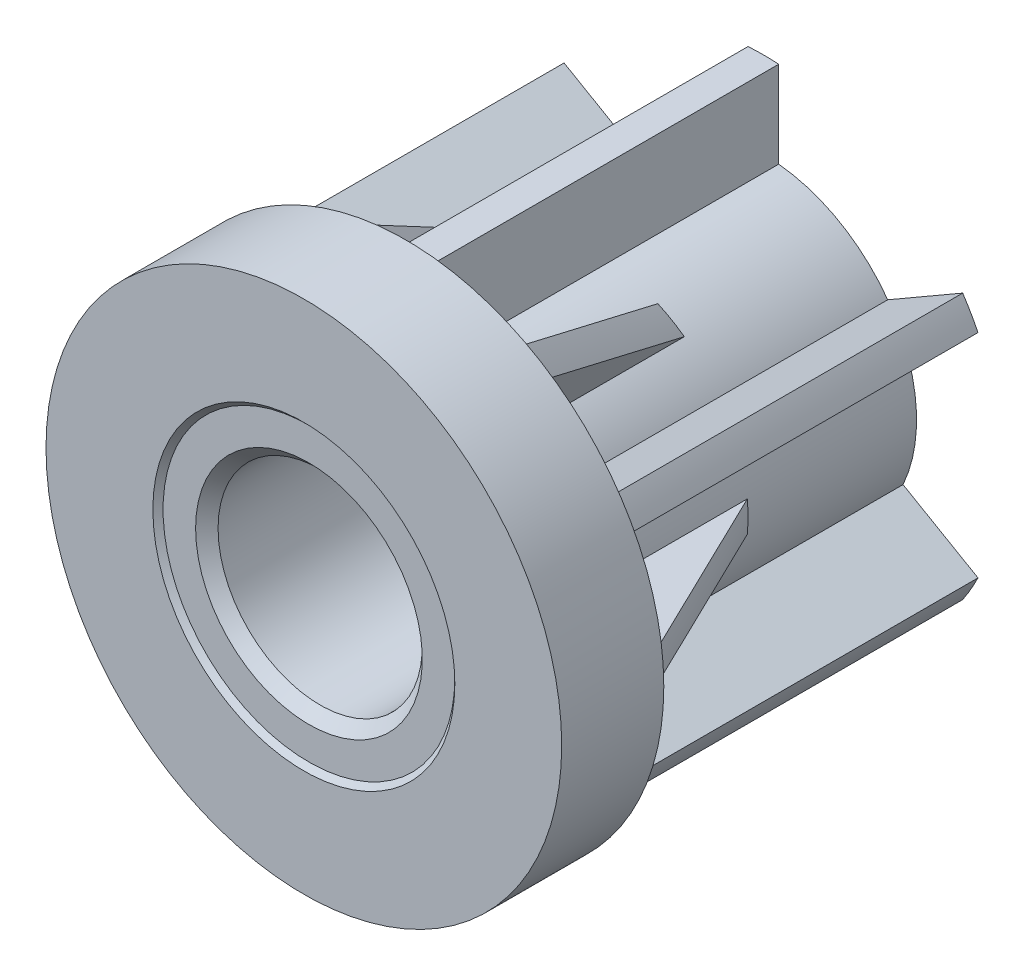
ISO-10303-21;
HEADER;
FILE_DESCRIPTION(('STEP AP214'),'2;1');
FILE_NAME('part.step','',(''),(''),'','','');
FILE_SCHEMA(('AUTOMOTIVE_DESIGN { 1 0 10303 214 1 1 1 1 }'));
ENDSEC;
DATA;
#1=APPLICATION_CONTEXT('core data for automotive mechanical design processes');
#2=APPLICATION_PROTOCOL_DEFINITION('international standard','automotive_design',2000,#1);
#3=PRODUCT_CONTEXT('',#1,'mechanical');
#4=PRODUCT('Part','Part','',(#3));
#5=PRODUCT_RELATED_PRODUCT_CATEGORY('part','',(#4));
#6=PRODUCT_DEFINITION_FORMATION('','',#4);
#7=PRODUCT_DEFINITION_CONTEXT('part definition',#1,'design');
#8=PRODUCT_DEFINITION('design','',#6,#7);
#9=PRODUCT_DEFINITION_SHAPE('','',#8);
#10=(LENGTH_UNIT() NAMED_UNIT(*) SI_UNIT(.MILLI.,.METRE.));
#11=(NAMED_UNIT(*) PLANE_ANGLE_UNIT() SI_UNIT($,.RADIAN.));
#12=(NAMED_UNIT(*) SI_UNIT($,.STERADIAN.) SOLID_ANGLE_UNIT());
#13=UNCERTAINTY_MEASURE_WITH_UNIT(LENGTH_MEASURE(1.E-05),#10,'distance_accuracy_value','');
#14=(GEOMETRIC_REPRESENTATION_CONTEXT(3) GLOBAL_UNCERTAINTY_ASSIGNED_CONTEXT((#13)) GLOBAL_UNIT_ASSIGNED_CONTEXT((#10,
#11,#12)) REPRESENTATION_CONTEXT('',''));
#15=CARTESIAN_POINT('',(0.,0.,0.));
#16=DIRECTION('',(0.,0.,1.));
#17=DIRECTION('',(1.,0.,0.));
#18=AXIS2_PLACEMENT_3D('',#15,#16,#17);
#19=CARTESIAN_POINT('',(0.,0.,-15.));
#20=DIRECTION('',(0.,0.,-1.));
#21=DIRECTION('',(-1.,0.,0.));
#22=AXIS2_PLACEMENT_3D('',#19,#20,#21);
#23=CYLINDRICAL_SURFACE('',#22,11.25);
#24=CARTESIAN_POINT('',(0.,0.,-20.));
#25=DIRECTION('',(0.,0.,-1.));
#26=DIRECTION('',(-1.,0.,0.));
#27=AXIS2_PLACEMENT_3D('',#24,#25,#26);
#28=CIRCLE('',#27,11.25);
#29=CARTESIAN_POINT('',(-11.25,0.,-20.));
#30=VERTEX_POINT('',#29);
#31=EDGE_CURVE('E1474',#30,#30,#28,.T.);
#32=ORIENTED_EDGE('',*,*,#31,.T.);
#33=EDGE_LOOP('',(#32));
#34=FACE_BOUND('',#33,.T.);
#35=CARTESIAN_POINT('',(0.,0.,-10.));
#36=DIRECTION('',(0.,0.,-1.));
#37=DIRECTION('',(-1.,0.,0.));
#38=AXIS2_PLACEMENT_3D('',#35,#36,#37);
#39=CIRCLE('',#38,11.25);
#40=CARTESIAN_POINT('',(-11.25,0.,-9.99999999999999));
#41=VERTEX_POINT('',#40);
#42=EDGE_CURVE('E1479',#41,#41,#39,.F.);
#43=ORIENTED_EDGE('',*,*,#42,.T.);
#44=EDGE_LOOP('',(#43));
#45=FACE_BOUND('',#44,.T.);
#46=ADVANCED_FACE('F14',(#34,#45),#23,.F.);
#47=CARTESIAN_POINT('',(0.,10.625,-10.));
#48=DIRECTION('',(0.,0.,1.));
#49=DIRECTION('',(1.,0.,0.));
#50=AXIS2_PLACEMENT_3D('',#47,#48,#49);
#51=PLANE('',#50);
#52=ORIENTED_EDGE('',*,*,#42,.F.);
#53=EDGE_LOOP('',(#52));
#54=FACE_BOUND('',#53,.T.);
#55=CARTESIAN_POINT('',(0.,0.,-10.));
#56=DIRECTION('',(0.,0.,-1.));
#57=DIRECTION('',(-1.,0.,0.));
#58=AXIS2_PLACEMENT_3D('',#55,#56,#57);
#59=CIRCLE('',#58,10.);
#60=CARTESIAN_POINT('',(-10.,0.,-10.));
#61=VERTEX_POINT('',#60);
#62=EDGE_CURVE('E1472',#61,#61,#59,.F.);
#63=ORIENTED_EDGE('',*,*,#62,.T.);
#64=EDGE_LOOP('',(#63));
#65=FACE_BOUND('',#64,.T.);
#66=ADVANCED_FACE('F1398',(#54,#65),#51,.F.);
#67=CARTESIAN_POINT('',(0.,11.875,-20.));
#68=DIRECTION('',(0.,0.,1.));
#69=DIRECTION('',(1.,0.,0.));
#70=AXIS2_PLACEMENT_3D('',#67,#68,#69);
#71=PLANE('',#70);
#72=CARTESIAN_POINT('',(0.,0.,-20.));
#73=DIRECTION('',(0.,0.,-1.));
#74=DIRECTION('',(-1.,0.,0.));
#75=AXIS2_PLACEMENT_3D('',#72,#73,#74);
#76=CIRCLE('',#75,12.5);
#77=CARTESIAN_POINT('',(-12.5,0.,-20.));
#78=VERTEX_POINT('',#77);
#79=EDGE_CURVE('E1468',#78,#78,#76,.T.);
#80=ORIENTED_EDGE('',*,*,#79,.T.);
#81=EDGE_LOOP('',(#80));
#82=FACE_BOUND('',#81,.T.);
#83=ORIENTED_EDGE('',*,*,#31,.F.);
#84=EDGE_LOOP('',(#83));
#85=FACE_BOUND('',#84,.T.);
#86=ADVANCED_FACE('F1407',(#82,#85),#71,.F.);
#87=CARTESIAN_POINT('',(0.,0.,-27.5));
#88=DIRECTION('',(0.,0.,-1.));
#89=DIRECTION('',(-1.,0.,0.));
#90=AXIS2_PLACEMENT_3D('',#87,#88,#89);
#91=CYLINDRICAL_SURFACE('',#90,12.5);
#92=ORIENTED_EDGE('',*,*,#79,.F.);
#93=EDGE_LOOP('',(#92));
#94=FACE_BOUND('',#93,.T.);
#95=CARTESIAN_POINT('',(0.,0.,-35.));
#96=DIRECTION('',(0.,0.,-1.));
#97=DIRECTION('',(-1.,0.,0.));
#98=AXIS2_PLACEMENT_3D('',#95,#96,#97);
#99=CIRCLE('',#98,12.5);
#100=CARTESIAN_POINT('',(-12.5,0.,-35.));
#101=VERTEX_POINT('',#100);
#102=EDGE_CURVE('E694',#101,#101,#99,.F.);
#103=ORIENTED_EDGE('',*,*,#102,.F.);
#104=EDGE_LOOP('',(#103));
#105=FACE_BOUND('',#104,.T.);
#106=ADVANCED_FACE('F1417',(#94,#105),#91,.F.);
#107=CARTESIAN_POINT('',(0.,0.,-0.999999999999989));
#108=DIRECTION('',(0.,0.,1.));
#109=DIRECTION('',(1.,0.,0.));
#110=AXIS2_PLACEMENT_3D('',#107,#108,#109);
#111=CONICAL_SURFACE('',#110,23.45,0.449839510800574);
#112=CARTESIAN_POINT('',(-23.4019764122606,-1.5,-0.999999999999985));
#113=CARTESIAN_POINT('',(-22.6962047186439,-1.5,-2.4586523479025));
#114=CARTESIAN_POINT('',(-21.9903363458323,-1.5,-3.91725793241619));
#115=CARTESIAN_POINT('',(-20.5783155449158,-1.5,-6.83433145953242));
#116=CARTESIAN_POINT('',(-19.872163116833,-1.5,-8.29279940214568));
#117=CARTESIAN_POINT('',(-18.4594833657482,-1.5,-11.2095538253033));
#118=CARTESIAN_POINT('',(-17.7529560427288,-1.49999999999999,-12.6678403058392));
#119=CARTESIAN_POINT('',(-16.3393457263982,-1.5,-15.5841440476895));
#120=CARTESIAN_POINT('',(-15.6322627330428,-1.5,-17.0421613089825));
#121=CARTESIAN_POINT('',(-14.9248115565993,-1.5,-18.5));
#122=B_SPLINE_CURVE_WITH_KNOTS('',3,(#112,#113,#114,#115,#116,#117,#118,#119,#120,#121),
.UNSPECIFIED.,.F.,.F.,(4,2,2,2,4),(0.,4.86127795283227,9.72255552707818,14.5838333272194,
19.4451115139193),.UNSPECIFIED.);
#123=CARTESIAN_POINT('',(-23.4019764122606,-1.5,-0.999999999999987));
#124=VERTEX_POINT('',#123);
#125=CARTESIAN_POINT('',(-14.9248115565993,-1.5,-18.5));
#126=VERTEX_POINT('',#125);
#127=EDGE_CURVE('E683',#124,#126,#122,.T.);
#128=ORIENTED_EDGE('',*,*,#127,.F.);
#129=CARTESIAN_POINT('',(5.25332780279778E-13,1.8870340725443E-13,-1.));
#130=DIRECTION('',(0.,0.,1.));
#131=DIRECTION('',(1.,0.,0.));
#132=AXIS2_PLACEMENT_3D('',#129,#130,#131);
#133=CIRCLE('',#132,23.4500000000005);
#134=CARTESIAN_POINT('',(-23.4019764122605,1.5,-0.999999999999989));
#135=VERTEX_POINT('',#134);
#136=EDGE_CURVE('E323',#135,#124,#133,.T.);
#137=ORIENTED_EDGE('',*,*,#136,.F.);
#138=CARTESIAN_POINT('',(-14.9248115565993,1.5,-18.5));
#139=CARTESIAN_POINT('',(-15.6322627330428,1.5,-17.0421613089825));
#140=CARTESIAN_POINT('',(-16.3393457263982,1.5,-15.5841440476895));
#141=CARTESIAN_POINT('',(-17.7529560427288,1.5,-12.6678403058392));
#142=CARTESIAN_POINT('',(-18.4594833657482,1.5,-11.2095538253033));
#143=CARTESIAN_POINT('',(-19.872163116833,1.5,-8.29279940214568));
#144=CARTESIAN_POINT('',(-20.5783155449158,1.5,-6.83433145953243));
#145=CARTESIAN_POINT('',(-21.9903363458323,1.5,-3.91725793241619));
#146=CARTESIAN_POINT('',(-22.6962047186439,1.5,-2.4586523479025));
#147=CARTESIAN_POINT('',(-23.4019764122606,1.5,-0.999999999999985));
#148=B_SPLINE_CURVE_WITH_KNOTS('',3,(#138,#139,#140,#141,#142,#143,#144,#145,#146,#147),
.UNSPECIFIED.,.F.,.F.,(4,2,2,2,4),(0.,4.86127818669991,9.72255598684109,14.583833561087,
19.4451115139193),.UNSPECIFIED.);
#149=CARTESIAN_POINT('',(-14.9248115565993,1.5,-18.5));
#150=VERTEX_POINT('',#149);
#151=EDGE_CURVE('E316',#150,#135,#148,.T.);
#152=ORIENTED_EDGE('',*,*,#151,.F.);
#153=CARTESIAN_POINT('',(0.,0.,-18.5));
#154=DIRECTION('',(0.,0.,-1.));
#155=DIRECTION('',(-1.,0.,0.));
#156=AXIS2_PLACEMENT_3D('',#153,#154,#155);
#157=CIRCLE('',#156,15.);
#158=EDGE_CURVE('E320',#126,#150,#157,.T.);
#159=ORIENTED_EDGE('',*,*,#158,.F.);
#160=EDGE_LOOP('',(#128,#137,#152,#159));
#161=FACE_BOUND('',#160,.T.);
#162=ADVANCED_FACE('F318',(#161),#111,.T.);
#163=CARTESIAN_POINT('',(0.,0.,-1.));
#164=DIRECTION('',(0.,0.,1.));
#165=DIRECTION('',(1.,0.,0.));
#166=AXIS2_PLACEMENT_3D('',#163,#164,#165);
#167=CONICAL_SURFACE('',#166,23.45,0.449839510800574);
#168=CARTESIAN_POINT('',(-10.4019501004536,-21.0167060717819,-1.));
#169=CARTESIAN_POINT('',(-10.0490642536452,-20.4054898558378,-2.45865234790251));
#170=CARTESIAN_POINT('',(-9.69613006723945,-19.794189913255,-3.9172579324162));
#171=CARTESIAN_POINT('',(-8.99011966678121,-18.5713440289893,-6.83433145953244));
#172=CARTESIAN_POINT('',(-8.63704345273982,-17.9597980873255,-8.29279940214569));
#173=CARTESIAN_POINT('',(-7.93070357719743,-16.7363815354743,-11.2095538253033));
#174=CARTESIAN_POINT('',(-7.57743991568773,-16.1245109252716,-12.6678403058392));
#175=CARTESIAN_POINT('',(-6.87063475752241,-14.9002884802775,-15.5841440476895));
#176=CARTESIAN_POINT('',(-6.51709326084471,-14.2879366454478,-17.0421613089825));
#177=CARTESIAN_POINT('',(-6.16336767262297,-13.6752659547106,-18.5));
#178=B_SPLINE_CURVE_WITH_KNOTS('',3,(#168,#169,#170,#171,#172,#173,#174,#175,#176,#177),
.UNSPECIFIED.,.F.,.F.,(4,2,2,2,4),(0.,4.86127795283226,9.72255552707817,14.5838333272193,
19.4451115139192),.UNSPECIFIED.);
#179=CARTESIAN_POINT('',(-10.4019501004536,-21.0167060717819,-1.));
#180=VERTEX_POINT('',#179);
#181=CARTESIAN_POINT('',(-6.16336767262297,-13.6752659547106,-18.5));
#182=VERTEX_POINT('',#181);
#183=EDGE_CURVE('E634',#180,#182,#178,.T.);
#184=ORIENTED_EDGE('',*,*,#183,.F.);
#185=CARTESIAN_POINT('',(-7.00353438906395E-13,-1.32497466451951E-12,-1.));
#186=DIRECTION('',(0.,0.,1.));
#187=DIRECTION('',(1.,0.,0.));
#188=AXIS2_PLACEMENT_3D('',#185,#186,#187);
#189=CIRCLE('',#188,23.4499999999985);
#190=CARTESIAN_POINT('',(-13.0000263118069,-19.5167060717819,-1.));
#191=VERTEX_POINT('',#190);
#192=EDGE_CURVE('E650',#191,#180,#189,.T.);
#193=ORIENTED_EDGE('',*,*,#192,.F.);
#194=CARTESIAN_POINT('',(-8.76144388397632,-12.1752659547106,-18.5));
#195=CARTESIAN_POINT('',(-9.11516947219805,-12.7879366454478,-17.0421613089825));
#196=CARTESIAN_POINT('',(-9.46871096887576,-13.4002884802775,-15.5841440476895));
#197=CARTESIAN_POINT('',(-10.1755161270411,-14.6245109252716,-12.6678403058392));
#198=CARTESIAN_POINT('',(-10.5287797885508,-15.2363815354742,-11.2095538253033));
#199=CARTESIAN_POINT('',(-11.2351196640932,-16.4597980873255,-8.29279940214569));
#200=CARTESIAN_POINT('',(-11.5881958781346,-17.0713440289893,-6.83433145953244));
#201=CARTESIAN_POINT('',(-12.2942062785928,-18.294189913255,-3.9172579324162));
#202=CARTESIAN_POINT('',(-12.6471404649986,-18.9054898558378,-2.45865234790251));
#203=CARTESIAN_POINT('',(-13.0000263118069,-19.5167060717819,-1.));
#204=B_SPLINE_CURVE_WITH_KNOTS('',3,(#194,#195,#196,#197,#198,#199,#200,#201,#202,#203),
.UNSPECIFIED.,.F.,.F.,(4,2,2,2,4),(0.,4.86127818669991,9.72255598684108,14.583833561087,
19.4451115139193),.UNSPECIFIED.);
#205=CARTESIAN_POINT('',(-8.7614438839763,-12.1752659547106,-18.5));
#206=VERTEX_POINT('',#205);
#207=EDGE_CURVE('E642',#206,#191,#204,.T.);
#208=ORIENTED_EDGE('',*,*,#207,.F.);
#209=CARTESIAN_POINT('',(0.,0.,-18.5));
#210=DIRECTION('',(0.,0.,-1.));
#211=DIRECTION('',(-1.,0.,0.));
#212=AXIS2_PLACEMENT_3D('',#209,#210,#211);
#213=CIRCLE('',#212,15.);
#214=EDGE_CURVE('E855',#182,#206,#213,.T.);
#215=ORIENTED_EDGE('',*,*,#214,.F.);
#216=EDGE_LOOP('',(#184,#193,#208,#215));
#217=FACE_BOUND('',#216,.T.);
#218=ADVANCED_FACE('F623',(#217),#167,.T.);
#219=CARTESIAN_POINT('',(0.,0.,-1.));
#220=DIRECTION('',(0.,0.,1.));
#221=DIRECTION('',(1.,0.,0.));
#222=AXIS2_PLACEMENT_3D('',#219,#220,#221);
#223=CONICAL_SURFACE('',#222,23.45,0.449839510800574);
#224=CARTESIAN_POINT('',(13.0000263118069,-19.5167060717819,-1.00000000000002));
#225=CARTESIAN_POINT('',(12.6471404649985,-18.9054898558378,-2.45865234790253));
#226=CARTESIAN_POINT('',(12.2942062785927,-18.294189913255,-3.91725793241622));
#227=CARTESIAN_POINT('',(11.5881958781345,-17.0713440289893,-6.83433145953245));
#228=CARTESIAN_POINT('',(11.2351196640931,-16.4597980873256,-8.29279940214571));
#229=CARTESIAN_POINT('',(10.5287797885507,-15.2363815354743,-11.2095538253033));
#230=CARTESIAN_POINT('',(10.175516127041,-14.6245109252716,-12.6678403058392));
#231=CARTESIAN_POINT('',(9.4687109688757,-13.4002884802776,-15.5841440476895));
#232=CARTESIAN_POINT('',(9.11516947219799,-12.7879366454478,-17.0421613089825));
#233=CARTESIAN_POINT('',(8.76144388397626,-12.1752659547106,-18.5));
#234=B_SPLINE_CURVE_WITH_KNOTS('',3,(#224,#225,#226,#227,#228,#229,#230,#231,#232,#233),
.UNSPECIFIED.,.F.,.F.,(4,2,2,2,4),(0.,4.86127795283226,9.72255552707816,14.5838333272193,
19.4451115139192),.UNSPECIFIED.);
#235=CARTESIAN_POINT('',(13.0000263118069,-19.5167060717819,-1.00000000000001));
#236=VERTEX_POINT('',#235);
#237=CARTESIAN_POINT('',(8.76144388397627,-12.1752659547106,-18.5));
#238=VERTEX_POINT('',#237);
#239=EDGE_CURVE('E604',#236,#238,#234,.T.);
#240=ORIENTED_EDGE('',*,*,#239,.F.);
#241=CARTESIAN_POINT('',(0.,-4.19032676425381E-13,-1.));
#242=DIRECTION('',(0.,0.,1.));
#243=DIRECTION('',(1.,0.,0.));
#244=AXIS2_PLACEMENT_3D('',#241,#242,#243);
#245=CIRCLE('',#244,23.4499999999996);
#246=CARTESIAN_POINT('',(10.4019501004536,-21.0167060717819,-1.));
#247=VERTEX_POINT('',#246);
#248=EDGE_CURVE('E835',#247,#236,#245,.T.);
#249=ORIENTED_EDGE('',*,*,#248,.F.);
#250=CARTESIAN_POINT('',(6.16336767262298,-13.6752659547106,-18.5));
#251=CARTESIAN_POINT('',(6.51709326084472,-14.2879366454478,-17.0421613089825));
#252=CARTESIAN_POINT('',(6.87063475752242,-14.9002884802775,-15.5841440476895));
#253=CARTESIAN_POINT('',(7.57743991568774,-16.1245109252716,-12.6678403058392));
#254=CARTESIAN_POINT('',(7.93070357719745,-16.7363815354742,-11.2095538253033));
#255=CARTESIAN_POINT('',(8.63704345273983,-17.9597980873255,-8.29279940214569));
#256=CARTESIAN_POINT('',(8.99011966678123,-18.5713440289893,-6.83433145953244));
#257=CARTESIAN_POINT('',(9.69613006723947,-19.794189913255,-3.9172579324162));
#258=CARTESIAN_POINT('',(10.0490642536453,-20.4054898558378,-2.45865234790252));
#259=CARTESIAN_POINT('',(10.4019501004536,-21.0167060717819,-1.));
#260=B_SPLINE_CURVE_WITH_KNOTS('',3,(#250,#251,#252,#253,#254,#255,#256,#257,#258,#259),
.UNSPECIFIED.,.F.,.F.,(4,2,2,2,4),(0.,4.86127818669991,9.72255598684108,14.583833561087,
19.4451115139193),.UNSPECIFIED.);
#261=CARTESIAN_POINT('',(6.16336767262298,-13.6752659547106,-18.5));
#262=VERTEX_POINT('',#261);
#263=EDGE_CURVE('E613',#262,#247,#260,.T.);
#264=ORIENTED_EDGE('',*,*,#263,.F.);
#265=CARTESIAN_POINT('',(0.,0.,-18.5));
#266=DIRECTION('',(0.,0.,-1.));
#267=DIRECTION('',(-1.,0.,0.));
#268=AXIS2_PLACEMENT_3D('',#265,#266,#267);
#269=CIRCLE('',#268,15.);
#270=EDGE_CURVE('E829',#238,#262,#269,.T.);
#271=ORIENTED_EDGE('',*,*,#270,.F.);
#272=EDGE_LOOP('',(#240,#249,#264,#271));
#273=FACE_BOUND('',#272,.T.);
#274=ADVANCED_FACE('F619',(#273),#223,.T.);
#275=CARTESIAN_POINT('',(0.,0.,-0.999999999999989));
#276=DIRECTION('',(0.,0.,1.));
#277=DIRECTION('',(1.,0.,0.));
#278=AXIS2_PLACEMENT_3D('',#275,#276,#277);
#279=CONICAL_SURFACE('',#278,23.45,0.449839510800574);
#280=CARTESIAN_POINT('',(14.9248115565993,-1.5,-18.5));
#281=CARTESIAN_POINT('',(15.6322627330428,-1.5,-17.0421613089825));
#282=CARTESIAN_POINT('',(16.3393457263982,-1.5,-15.5841440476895));
#283=CARTESIAN_POINT('',(17.7529560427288,-1.5,-12.6678403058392));
#284=CARTESIAN_POINT('',(18.4594833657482,-1.5,-11.2095538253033));
#285=CARTESIAN_POINT('',(19.872163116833,-1.5,-8.29279940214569));
#286=CARTESIAN_POINT('',(20.5783155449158,-1.5,-6.83433145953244));
#287=CARTESIAN_POINT('',(21.9903363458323,-1.5,-3.9172579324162));
#288=CARTESIAN_POINT('',(22.6962047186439,-1.5,-2.45865234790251));
#289=CARTESIAN_POINT('',(23.4019764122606,-1.5,-1.));
#290=B_SPLINE_CURVE_WITH_KNOTS('',3,(#280,#281,#282,#283,#284,#285,#286,#287,#288,#289),
.UNSPECIFIED.,.F.,.F.,(4,2,2,2,4),(0.,4.86127818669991,9.72255598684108,14.583833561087,
19.4451115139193),.UNSPECIFIED.);
#291=CARTESIAN_POINT('',(14.9248115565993,-1.5,-18.5));
#292=VERTEX_POINT('',#291);
#293=CARTESIAN_POINT('',(23.4019764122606,-1.5,-1.));
#294=VERTEX_POINT('',#293);
#295=EDGE_CURVE('E564',#292,#294,#290,.T.);
#296=ORIENTED_EDGE('',*,*,#295,.F.);
#297=CARTESIAN_POINT('',(0.,0.,-18.5));
#298=DIRECTION('',(0.,0.,-1.));
#299=DIRECTION('',(-1.,0.,0.));
#300=AXIS2_PLACEMENT_3D('',#297,#298,#299);
#301=CIRCLE('',#300,15.);
#302=CARTESIAN_POINT('',(14.9248115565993,1.5,-18.5));
#303=VERTEX_POINT('',#302);
#304=EDGE_CURVE('E805',#303,#292,#301,.T.);
#305=ORIENTED_EDGE('',*,*,#304,.F.);
#306=CARTESIAN_POINT('',(23.4019764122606,1.5,-1.));
#307=CARTESIAN_POINT('',(22.6962047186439,1.49999999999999,-2.45865234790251));
#308=CARTESIAN_POINT('',(21.9903363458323,1.49999999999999,-3.9172579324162));
#309=CARTESIAN_POINT('',(20.5783155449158,1.49999999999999,-6.83433145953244));
#310=CARTESIAN_POINT('',(19.872163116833,1.49999999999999,-8.29279940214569));
#311=CARTESIAN_POINT('',(18.4594833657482,1.49999999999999,-11.2095538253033));
#312=CARTESIAN_POINT('',(17.7529560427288,1.49999999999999,-12.6678403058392));
#313=CARTESIAN_POINT('',(16.3393457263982,1.5,-15.5841440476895));
#314=CARTESIAN_POINT('',(15.6322627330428,1.5,-17.0421613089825));
#315=CARTESIAN_POINT('',(14.9248115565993,1.5,-18.5));
#316=B_SPLINE_CURVE_WITH_KNOTS('',3,(#306,#307,#308,#309,#310,#311,#312,#313,#314,#315),
.UNSPECIFIED.,.F.,.F.,(4,2,2,2,4),(0.,4.86127795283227,9.72255552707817,14.5838333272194,
19.4451115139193),.UNSPECIFIED.);
#317=CARTESIAN_POINT('',(23.4019764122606,1.5,-1.));
#318=VERTEX_POINT('',#317);
#319=EDGE_CURVE('E555',#318,#303,#316,.T.);
#320=ORIENTED_EDGE('',*,*,#319,.F.);
#321=CARTESIAN_POINT('',(-4.97848759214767E-13,-1.98986472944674E-13,-1.));
#322=DIRECTION('',(0.,0.,1.));
#323=DIRECTION('',(1.,0.,0.));
#324=AXIS2_PLACEMENT_3D('',#321,#322,#323);
#325=CIRCLE('',#324,23.4500000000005);
#326=EDGE_CURVE('E571',#294,#318,#325,.T.);
#327=ORIENTED_EDGE('',*,*,#326,.F.);
#328=EDGE_LOOP('',(#296,#305,#320,#327));
#329=FACE_BOUND('',#328,.T.);
#330=ADVANCED_FACE('F498',(#329),#279,.T.);
#331=CARTESIAN_POINT('',(0.,0.,-1.));
#332=DIRECTION('',(0.,0.,1.));
#333=DIRECTION('',(1.,0.,0.));
#334=AXIS2_PLACEMENT_3D('',#331,#332,#333);
#335=CONICAL_SURFACE('',#334,23.45,0.449839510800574);
#336=CARTESIAN_POINT('',(10.4019501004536,21.0167060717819,-1.));
#337=CARTESIAN_POINT('',(10.0490642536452,20.4054898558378,-2.45865234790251));
#338=CARTESIAN_POINT('',(9.69613006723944,19.794189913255,-3.9172579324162));
#339=CARTESIAN_POINT('',(8.99011966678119,18.5713440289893,-6.83433145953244));
#340=CARTESIAN_POINT('',(8.6370434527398,17.9597980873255,-8.29279940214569));
#341=CARTESIAN_POINT('',(7.93070357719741,16.7363815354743,-11.2095538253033));
#342=CARTESIAN_POINT('',(7.5774399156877,16.1245109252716,-12.6678403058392));
#343=CARTESIAN_POINT('',(6.87063475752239,14.9002884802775,-15.5841440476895));
#344=CARTESIAN_POINT('',(6.51709326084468,14.2879366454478,-17.0421613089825));
#345=CARTESIAN_POINT('',(6.16336767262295,13.6752659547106,-18.5));
#346=B_SPLINE_CURVE_WITH_KNOTS('',3,(#336,#337,#338,#339,#340,#341,#342,#343,#344,#345),
.UNSPECIFIED.,.F.,.F.,(4,2,2,2,4),(0.,4.86127795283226,9.72255552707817,14.5838333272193,
19.4451115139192),.UNSPECIFIED.);
#347=CARTESIAN_POINT('',(10.4019501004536,21.0167060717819,-1.));
#348=VERTEX_POINT('',#347);
#349=CARTESIAN_POINT('',(6.16336767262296,13.6752659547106,-18.5));
#350=VERTEX_POINT('',#349);
#351=EDGE_CURVE('E504',#348,#350,#346,.T.);
#352=ORIENTED_EDGE('',*,*,#351,.F.);
#353=CARTESIAN_POINT('',(3.63684307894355E-13,5.33094589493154E-13,-1.));
#354=DIRECTION('',(0.,0.,1.));
#355=DIRECTION('',(1.,0.,0.));
#356=AXIS2_PLACEMENT_3D('',#353,#354,#355);
#357=CIRCLE('',#356,23.4499999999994);
#358=CARTESIAN_POINT('',(13.0000263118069,19.5167060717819,-1.));
#359=VERTEX_POINT('',#358);
#360=EDGE_CURVE('E520',#359,#348,#357,.T.);
#361=ORIENTED_EDGE('',*,*,#360,.F.);
#362=CARTESIAN_POINT('',(8.7614438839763,12.1752659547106,-18.5));
#363=CARTESIAN_POINT('',(9.11516947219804,12.7879366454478,-17.0421613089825));
#364=CARTESIAN_POINT('',(9.46871096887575,13.4002884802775,-15.5841440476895));
#365=CARTESIAN_POINT('',(10.1755161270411,14.6245109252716,-12.6678403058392));
#366=CARTESIAN_POINT('',(10.5287797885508,15.2363815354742,-11.2095538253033));
#367=CARTESIAN_POINT('',(11.2351196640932,16.4597980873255,-8.29279940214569));
#368=CARTESIAN_POINT('',(11.5881958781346,17.0713440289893,-6.83433145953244));
#369=CARTESIAN_POINT('',(12.2942062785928,18.294189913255,-3.9172579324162));
#370=CARTESIAN_POINT('',(12.6471404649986,18.9054898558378,-2.45865234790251));
#371=CARTESIAN_POINT('',(13.0000263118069,19.5167060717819,-1.));
#372=B_SPLINE_CURVE_WITH_KNOTS('',3,(#362,#363,#364,#365,#366,#367,#368,#369,#370,#371),
.UNSPECIFIED.,.F.,.F.,(4,2,2,2,4),(0.,4.86127818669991,9.72255598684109,14.583833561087,
19.4451115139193),.UNSPECIFIED.);
#373=CARTESIAN_POINT('',(8.76144388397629,12.1752659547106,-18.5));
#374=VERTEX_POINT('',#373);
#375=EDGE_CURVE('E512',#374,#359,#372,.T.);
#376=ORIENTED_EDGE('',*,*,#375,.F.);
#377=CARTESIAN_POINT('',(0.,0.,-18.5));
#378=DIRECTION('',(0.,0.,-1.));
#379=DIRECTION('',(-1.,0.,0.));
#380=AXIS2_PLACEMENT_3D('',#377,#378,#379);
#381=CIRCLE('',#380,15.);
#382=EDGE_CURVE('E780',#350,#374,#381,.T.);
#383=ORIENTED_EDGE('',*,*,#382,.F.);
#384=EDGE_LOOP('',(#352,#361,#376,#383));
#385=FACE_BOUND('',#384,.T.);
#386=ADVANCED_FACE('F491',(#385),#335,.T.);
#387=CARTESIAN_POINT('',(0.,0.,-1.));
#388=DIRECTION('',(0.,0.,1.));
#389=DIRECTION('',(1.,0.,0.));
#390=AXIS2_PLACEMENT_3D('',#387,#388,#389);
#391=CONICAL_SURFACE('',#390,23.45,0.449839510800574);
#392=CARTESIAN_POINT('',(-13.0000263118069,19.5167060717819,-1.));
#393=CARTESIAN_POINT('',(-12.6471404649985,18.9054898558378,-2.45865234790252));
#394=CARTESIAN_POINT('',(-12.2942062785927,18.294189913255,-3.91725793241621));
#395=CARTESIAN_POINT('',(-11.5881958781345,17.0713440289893,-6.83433145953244));
#396=CARTESIAN_POINT('',(-11.2351196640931,16.4597980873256,-8.2927994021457));
#397=CARTESIAN_POINT('',(-10.5287797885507,15.2363815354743,-11.2095538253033));
#398=CARTESIAN_POINT('',(-10.175516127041,14.6245109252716,-12.6678403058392));
#399=CARTESIAN_POINT('',(-9.46871096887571,13.4002884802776,-15.5841440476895));
#400=CARTESIAN_POINT('',(-9.11516947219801,12.7879366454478,-17.0421613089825));
#401=CARTESIAN_POINT('',(-8.76144388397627,12.1752659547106,-18.5));
#402=B_SPLINE_CURVE_WITH_KNOTS('',3,(#392,#393,#394,#395,#396,#397,#398,#399,#400,#401),
.UNSPECIFIED.,.F.,.F.,(4,2,2,2,4),(0.,4.86127795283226,9.72255552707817,14.5838333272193,
19.4451115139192),.UNSPECIFIED.);
#403=CARTESIAN_POINT('',(-13.0000263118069,19.5167060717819,-0.999999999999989));
#404=VERTEX_POINT('',#403);
#405=CARTESIAN_POINT('',(-8.76144388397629,12.1752659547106,-18.5));
#406=VERTEX_POINT('',#405);
#407=EDGE_CURVE('E464',#404,#406,#402,.T.);
#408=ORIENTED_EDGE('',*,*,#407,.F.);
#409=CARTESIAN_POINT('',(3.10393602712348E-13,-6.14431928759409E-13,-1.));
#410=DIRECTION('',(0.,0.,1.));
#411=DIRECTION('',(1.,0.,0.));
#412=AXIS2_PLACEMENT_3D('',#409,#410,#411);
#413=CIRCLE('',#412,23.4500000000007);
#414=CARTESIAN_POINT('',(-10.4019501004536,21.0167060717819,-1.));
#415=VERTEX_POINT('',#414);
#416=EDGE_CURVE('E888',#415,#404,#413,.T.);
#417=ORIENTED_EDGE('',*,*,#416,.F.);
#418=CARTESIAN_POINT('',(-6.163367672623,13.6752659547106,-18.5));
#419=CARTESIAN_POINT('',(-6.51709326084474,14.2879366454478,-17.0421613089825));
#420=CARTESIAN_POINT('',(-6.87063475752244,14.9002884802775,-15.5841440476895));
#421=CARTESIAN_POINT('',(-7.57743991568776,16.1245109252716,-12.6678403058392));
#422=CARTESIAN_POINT('',(-7.93070357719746,16.7363815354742,-11.2095538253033));
#423=CARTESIAN_POINT('',(-8.63704345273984,17.9597980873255,-8.29279940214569));
#424=CARTESIAN_POINT('',(-8.99011966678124,18.5713440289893,-6.83433145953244));
#425=CARTESIAN_POINT('',(-9.69613006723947,19.794189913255,-3.9172579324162));
#426=CARTESIAN_POINT('',(-10.0490642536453,20.4054898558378,-2.45865234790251));
#427=CARTESIAN_POINT('',(-10.4019501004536,21.0167060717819,-1.));
#428=B_SPLINE_CURVE_WITH_KNOTS('',3,(#418,#419,#420,#421,#422,#423,#424,#425,#426,#427),
.UNSPECIFIED.,.F.,.F.,(4,2,2,2,4),(0.,4.86127818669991,9.72255598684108,14.583833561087,
19.4451115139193),.UNSPECIFIED.);
#429=CARTESIAN_POINT('',(-6.163367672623,13.6752659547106,-18.5));
#430=VERTEX_POINT('',#429);
#431=EDGE_CURVE('E474',#430,#415,#428,.T.);
#432=ORIENTED_EDGE('',*,*,#431,.F.);
#433=CARTESIAN_POINT('',(0.,0.,-18.5));
#434=DIRECTION('',(0.,0.,-1.));
#435=DIRECTION('',(-1.,0.,0.));
#436=AXIS2_PLACEMENT_3D('',#433,#434,#435);
#437=CIRCLE('',#436,15.);
#438=EDGE_CURVE('E760',#406,#430,#437,.T.);
#439=ORIENTED_EDGE('',*,*,#438,.F.);
#440=EDGE_LOOP('',(#408,#417,#432,#439));
#441=FACE_BOUND('',#440,.T.);
#442=ADVANCED_FACE('F485',(#441),#391,.T.);
#443=CARTESIAN_POINT('',(0.,7.5,-35.));
#444=DIRECTION('',(0.,0.,-1.));
#445=DIRECTION('',(-1.,0.,0.));
#446=AXIS2_PLACEMENT_3D('',#443,#444,#445);
#447=PLANE('',#446);
#448=CARTESIAN_POINT('',(-6.45239867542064E-13,4.71969310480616E-13,-35.));
#449=DIRECTION('',(0.,0.,1.));
#450=DIRECTION('',(1.,0.,0.));
#451=AXIS2_PLACEMENT_3D('',#448,#449,#450);
#452=CIRCLE('',#451,23.4499999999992);
#453=CARTESIAN_POINT('',(-19.5167060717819,13.0000263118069,-35.));
#454=VERTEX_POINT('',#453);
#455=CARTESIAN_POINT('',(-21.0167060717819,10.4019501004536,-35.));
#456=VERTEX_POINT('',#455);
#457=EDGE_CURVE('E456',#454,#456,#452,.T.);
#458=ORIENTED_EDGE('',*,*,#457,.F.);
#459=DIRECTION('',(0.866025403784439,-0.5,0.));
#460=VECTOR('',#459,1.);
#461=CARTESIAN_POINT('',(-6.93521307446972,5.73609794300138,-35.));
#462=LINE('',#461,#460);
#463=CARTESIAN_POINT('',(-12.1752659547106,8.76144388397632,-35.));
#464=VERTEX_POINT('',#463);
#465=EDGE_CURVE('E882',#464,#454,#462,.F.);
#466=ORIENTED_EDGE('',*,*,#465,.F.);
#467=CARTESIAN_POINT('',(0.,0.,-35.));
#468=DIRECTION('',(0.,0.,-1.));
#469=DIRECTION('',(-1.,0.,0.));
#470=AXIS2_PLACEMENT_3D('',#467,#468,#469);
#471=CIRCLE('',#470,15.);
#472=CARTESIAN_POINT('',(-1.5,14.9248115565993,-35.));
#473=VERTEX_POINT('',#472);
#474=EDGE_CURVE('E460',#473,#464,#471,.F.);
#475=ORIENTED_EDGE('',*,*,#474,.F.);
#476=DIRECTION('',(0.,1.,0.));
#477=VECTOR('',#476,1.);
#478=CARTESIAN_POINT('',(-1.5,23.4019764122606,-35.));
#479=LINE('',#478,#477);
#480=CARTESIAN_POINT('',(-1.5,23.4019764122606,-35.));
#481=VERTEX_POINT('',#480);
#482=EDGE_CURVE('E767',#481,#473,#479,.F.);
#483=ORIENTED_EDGE('',*,*,#482,.F.);
#484=CARTESIAN_POINT('',(0.,-5.22790519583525E-13,-35.));
#485=DIRECTION('',(0.,0.,1.));
#486=DIRECTION('',(1.,0.,0.));
#487=AXIS2_PLACEMENT_3D('',#484,#485,#486);
#488=CIRCLE('',#487,23.4500000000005);
#489=CARTESIAN_POINT('',(1.49999999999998,23.4019764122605,-35.));
#490=VERTEX_POINT('',#489);
#491=EDGE_CURVE('E768',#490,#481,#488,.T.);
#492=ORIENTED_EDGE('',*,*,#491,.F.);
#493=DIRECTION('',(0.,-1.,0.));
#494=VECTOR('',#493,1.);
#495=CARTESIAN_POINT('',(1.49999999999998,8.87411967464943,-35.));
#496=LINE('',#495,#494);
#497=CARTESIAN_POINT('',(1.49999999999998,14.9248115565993,-35.));
#498=VERTEX_POINT('',#497);
#499=EDGE_CURVE('E772',#498,#490,#496,.F.);
#500=ORIENTED_EDGE('',*,*,#499,.F.);
#501=CARTESIAN_POINT('',(0.,0.,-35.));
#502=DIRECTION('',(0.,0.,-1.));
#503=DIRECTION('',(-1.,0.,0.));
#504=AXIS2_PLACEMENT_3D('',#501,#502,#503);
#505=CIRCLE('',#504,15.);
#506=CARTESIAN_POINT('',(12.1752659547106,8.76144388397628,-35.));
#507=VERTEX_POINT('',#506);
#508=EDGE_CURVE('E776',#507,#498,#505,.F.);
#509=ORIENTED_EDGE('',*,*,#508,.F.);
#510=DIRECTION('',(0.866025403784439,0.5,0.));
#511=VECTOR('',#510,1.);
#512=CARTESIAN_POINT('',(19.5167060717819,13.0000263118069,-35.));
#513=LINE('',#512,#511);
#514=CARTESIAN_POINT('',(19.5167060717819,13.0000263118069,-35.));
#515=VERTEX_POINT('',#514);
#516=EDGE_CURVE('E521',#515,#507,#513,.F.);
#517=ORIENTED_EDGE('',*,*,#516,.F.);
#518=CARTESIAN_POINT('',(3.56625389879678E-13,1.13145228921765E-13,-35.));
#519=DIRECTION('',(0.,0.,1.));
#520=DIRECTION('',(1.,0.,0.));
#521=AXIS2_PLACEMENT_3D('',#518,#519,#520);
#522=CIRCLE('',#521,23.4499999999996);
#523=CARTESIAN_POINT('',(21.0167060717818,10.4019501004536,-35.));
#524=VERTEX_POINT('',#523);
#525=EDGE_CURVE('E522',#524,#515,#522,.T.);
#526=ORIENTED_EDGE('',*,*,#525,.F.);
#527=DIRECTION('',(-0.866025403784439,-0.5,0.));
#528=VECTOR('',#527,1.);
#529=CARTESIAN_POINT('',(8.43521307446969,3.13802173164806,-35.));
#530=LINE('',#529,#528);
#531=CARTESIAN_POINT('',(13.6752659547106,6.163367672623,-35.));
#532=VERTEX_POINT('',#531);
#533=EDGE_CURVE('E798',#532,#524,#530,.F.);
#534=ORIENTED_EDGE('',*,*,#533,.F.);
#535=CARTESIAN_POINT('',(0.,0.,-35.));
#536=DIRECTION('',(0.,0.,-1.));
#537=DIRECTION('',(-1.,0.,0.));
#538=AXIS2_PLACEMENT_3D('',#535,#536,#537);
#539=CIRCLE('',#538,15.);
#540=CARTESIAN_POINT('',(13.6752659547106,-6.16336767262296,-35.));
#541=VERTEX_POINT('',#540);
#542=EDGE_CURVE('E563',#541,#532,#539,.F.);
#543=ORIENTED_EDGE('',*,*,#542,.F.);
#544=DIRECTION('',(0.866025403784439,-0.5,0.));
#545=VECTOR('',#544,1.);
#546=CARTESIAN_POINT('',(21.0167060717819,-10.4019501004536,-35.));
#547=LINE('',#546,#545);
#548=CARTESIAN_POINT('',(21.0167060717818,-10.4019501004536,-35.));
#549=VERTEX_POINT('',#548);
#550=EDGE_CURVE('E572',#549,#541,#547,.F.);
#551=ORIENTED_EDGE('',*,*,#550,.F.);
#552=CARTESIAN_POINT('',(1.08493169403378E-12,-6.79109921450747E-13,-35.));
#553=DIRECTION('',(0.,0.,1.));
#554=DIRECTION('',(1.,0.,0.));
#555=AXIS2_PLACEMENT_3D('',#552,#553,#554);
#556=CIRCLE('',#555,23.4499999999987);
#557=CARTESIAN_POINT('',(19.5167060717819,-13.0000263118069,-35.));
#558=VERTEX_POINT('',#557);
#559=EDGE_CURVE('E573',#558,#549,#556,.T.);
#560=ORIENTED_EDGE('',*,*,#559,.F.);
#561=DIRECTION('',(-0.866025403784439,0.5,0.));
#562=VECTOR('',#561,1.);
#563=CARTESIAN_POINT('',(6.93521307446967,-5.73609794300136,-35.));
#564=LINE('',#563,#562);
#565=CARTESIAN_POINT('',(12.1752659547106,-8.76144388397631,-35.));
#566=VERTEX_POINT('',#565);
#567=EDGE_CURVE('E821',#566,#558,#564,.F.);
#568=ORIENTED_EDGE('',*,*,#567,.F.);
#569=CARTESIAN_POINT('',(0.,0.,-35.));
#570=DIRECTION('',(0.,0.,-1.));
#571=DIRECTION('',(-1.,0.,0.));
#572=AXIS2_PLACEMENT_3D('',#569,#570,#571);
#573=CIRCLE('',#572,15.);
#574=CARTESIAN_POINT('',(1.49999999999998,-14.9248115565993,-35.));
#575=VERTEX_POINT('',#574);
#576=EDGE_CURVE('E612',#575,#566,#573,.F.);
#577=ORIENTED_EDGE('',*,*,#576,.F.);
#578=DIRECTION('',(0.,-1.,0.));
#579=VECTOR('',#578,1.);
#580=CARTESIAN_POINT('',(1.49999999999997,-23.4019764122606,-35.));
#581=LINE('',#580,#579);
#582=CARTESIAN_POINT('',(1.49999999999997,-23.4019764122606,-35.));
#583=VERTEX_POINT('',#582);
#584=EDGE_CURVE('E842',#583,#575,#581,.F.);
#585=ORIENTED_EDGE('',*,*,#584,.F.);
#586=CARTESIAN_POINT('',(0.,5.07496447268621E-13,-35.));
#587=DIRECTION('',(0.,0.,1.));
#588=DIRECTION('',(1.,0.,0.));
#589=AXIS2_PLACEMENT_3D('',#586,#587,#588);
#590=CIRCLE('',#589,23.4500000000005);
#591=CARTESIAN_POINT('',(-1.5,-23.4019764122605,-35.));
#592=VERTEX_POINT('',#591);
#593=EDGE_CURVE('E843',#592,#583,#590,.T.);
#594=ORIENTED_EDGE('',*,*,#593,.F.);
#595=DIRECTION('',(0.,1.,0.));
#596=VECTOR('',#595,1.);
#597=CARTESIAN_POINT('',(-1.5,-8.87411967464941,-35.));
#598=LINE('',#597,#596);
#599=CARTESIAN_POINT('',(-1.5,-14.9248115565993,-35.));
#600=VERTEX_POINT('',#599);
#601=EDGE_CURVE('E847',#600,#592,#598,.F.);
#602=ORIENTED_EDGE('',*,*,#601,.F.);
#603=CARTESIAN_POINT('',(0.,0.,-35.));
#604=DIRECTION('',(0.,0.,-1.));
#605=DIRECTION('',(-1.,0.,0.));
#606=AXIS2_PLACEMENT_3D('',#603,#604,#605);
#607=CIRCLE('',#606,15.);
#608=CARTESIAN_POINT('',(-12.1752659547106,-8.76144388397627,-35.));
#609=VERTEX_POINT('',#608);
#610=EDGE_CURVE('E856',#609,#600,#607,.F.);
#611=ORIENTED_EDGE('',*,*,#610,.F.);
#612=DIRECTION('',(-0.866025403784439,-0.5,0.));
#613=VECTOR('',#612,1.);
#614=CARTESIAN_POINT('',(-19.5167060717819,-13.0000263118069,-35.));
#615=LINE('',#614,#613);
#616=CARTESIAN_POINT('',(-19.5167060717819,-13.0000263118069,-35.));
#617=VERTEX_POINT('',#616);
#618=EDGE_CURVE('E651',#617,#609,#615,.F.);
#619=ORIENTED_EDGE('',*,*,#618,.F.);
#620=CARTESIAN_POINT('',(3.28203680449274E-13,2.62359203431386E-13,-35.));
#621=DIRECTION('',(0.,0.,1.));
#622=DIRECTION('',(1.,0.,0.));
#623=AXIS2_PLACEMENT_3D('',#620,#621,#622);
#624=CIRCLE('',#623,23.4500000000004);
#625=CARTESIAN_POINT('',(-21.0167060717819,-10.4019501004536,-35.));
#626=VERTEX_POINT('',#625);
#627=EDGE_CURVE('E652',#626,#617,#624,.T.);
#628=ORIENTED_EDGE('',*,*,#627,.F.);
#629=DIRECTION('',(0.866025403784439,0.5,0.));
#630=VECTOR('',#629,1.);
#631=CARTESIAN_POINT('',(-8.43521307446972,-3.13802173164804,-35.));
#632=LINE('',#631,#630);
#633=CARTESIAN_POINT('',(-13.6752659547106,-6.16336767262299,-35.));
#634=VERTEX_POINT('',#633);
#635=EDGE_CURVE('E346',#634,#626,#632,.F.);
#636=ORIENTED_EDGE('',*,*,#635,.F.);
#637=CARTESIAN_POINT('',(0.,0.,-35.));
#638=DIRECTION('',(0.,0.,-1.));
#639=DIRECTION('',(-1.,0.,0.));
#640=AXIS2_PLACEMENT_3D('',#637,#638,#639);
#641=CIRCLE('',#640,15.);
#642=CARTESIAN_POINT('',(-13.6752659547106,6.16336767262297,-35.));
#643=VERTEX_POINT('',#642);
#644=EDGE_CURVE('E342',#643,#634,#641,.F.);
#645=ORIENTED_EDGE('',*,*,#644,.F.);
#646=DIRECTION('',(-0.866025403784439,0.5,0.));
#647=VECTOR('',#646,1.);
#648=CARTESIAN_POINT('',(-21.0167060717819,10.4019501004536,-35.));
#649=LINE('',#648,#647);
#650=EDGE_CURVE('E326',#456,#643,#649,.F.);
#651=ORIENTED_EDGE('',*,*,#650,.F.);
#652=EDGE_LOOP('',(#458,#466,#475,#483,#492,#500,#509,#517,#526,#534,#543,#551,#560,#568,#577,
#585,#594,#602,#611,#619,#628,#636,#645,#651));
#653=FACE_BOUND('',#652,.T.);
#654=ORIENTED_EDGE('',*,*,#102,.T.);
#655=EDGE_LOOP('',(#654));
#656=FACE_BOUND('',#655,.T.);
#657=ADVANCED_FACE('F490',(#653,#656),#447,.T.);
#658=CARTESIAN_POINT('',(-21.0167060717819,10.4019501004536,10.));
#659=DIRECTION('',(-0.5,-0.866025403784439,0.));
#660=DIRECTION('',(-0.866025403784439,0.5,0.));
#661=AXIS2_PLACEMENT_3D('',#658,#659,#660);
#662=PLANE('',#661);
#663=ORIENTED_EDGE('',*,*,#650,.T.);
#664=DIRECTION('',(0.,0.,-1.));
#665=VECTOR('',#664,1.);
#666=CARTESIAN_POINT('',(-13.6752659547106,6.16336767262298,-17.5));
#667=LINE('',#666,#665);
#668=CARTESIAN_POINT('',(-13.6752659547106,6.16336767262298,0.));
#669=VERTEX_POINT('',#668);
#670=EDGE_CURVE('E877',#669,#643,#667,.T.);
#671=ORIENTED_EDGE('',*,*,#670,.F.);
#672=DIRECTION('',(0.86602540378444,-0.5,0.));
#673=VECTOR('',#672,1.);
#674=CARTESIAN_POINT('',(-21.0167060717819,10.4019501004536,0.));
#675=LINE('',#674,#673);
#676=CARTESIAN_POINT('',(-21.0167060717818,10.4019501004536,0.));
#677=VERTEX_POINT('',#676);
#678=EDGE_CURVE('E455',#677,#669,#675,.T.);
#679=ORIENTED_EDGE('',*,*,#678,.F.);
#680=DIRECTION('',(0.,0.,1.));
#681=VECTOR('',#680,1.);
#682=CARTESIAN_POINT('',(-21.0167060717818,10.4019501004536,10.));
#683=LINE('',#682,#681);
#684=EDGE_CURVE('E459',#456,#677,#683,.T.);
#685=ORIENTED_EDGE('',*,*,#684,.F.);
#686=EDGE_LOOP('',(#663,#671,#679,#685));
#687=FACE_BOUND('',#686,.T.);
#688=ADVANCED_FACE('F698',(#687),#662,.T.);
#689=CARTESIAN_POINT('',(-8.87411967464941,1.5,10.));
#690=DIRECTION('',(0.,1.,0.));
#691=DIRECTION('',(1.,0.,0.));
#692=AXIS2_PLACEMENT_3D('',#689,#690,#691);
#693=PLANE('',#692);
#694=DIRECTION('',(-1.,0.,0.));
#695=VECTOR('',#694,1.);
#696=CARTESIAN_POINT('',(0.,1.5,0.));
#697=LINE('',#696,#695);
#698=CARTESIAN_POINT('',(-14.9248115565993,1.5,0.));
#699=VERTEX_POINT('',#698);
#700=CARTESIAN_POINT('',(-23.4019764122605,1.5,0.));
#701=VERTEX_POINT('',#700);
#702=EDGE_CURVE('E332',#699,#701,#697,.T.);
#703=ORIENTED_EDGE('',*,*,#702,.F.);
#704=DIRECTION('',(0.,0.,-1.));
#705=VECTOR('',#704,1.);
#706=CARTESIAN_POINT('',(-14.9248115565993,1.5,-17.5));
#707=LINE('',#706,#705);
#708=EDGE_CURVE('E329',#150,#699,#707,.F.);
#709=ORIENTED_EDGE('',*,*,#708,.F.);
#710=ORIENTED_EDGE('',*,*,#151,.T.);
#711=DIRECTION('',(0.,0.,1.));
#712=VECTOR('',#711,1.);
#713=CARTESIAN_POINT('',(-23.4019764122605,1.5,10.));
#714=LINE('',#713,#712);
#715=EDGE_CURVE('E349',#701,#135,#714,.F.);
#716=ORIENTED_EDGE('',*,*,#715,.F.);
#717=EDGE_LOOP('',(#703,#709,#710,#716));
#718=FACE_BOUND('',#717,.T.);
#719=ADVANCED_FACE('F330',(#718),#693,.T.);
#720=CARTESIAN_POINT('',(5.30490066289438E-13,1.86640492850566E-13,10.));
#721=DIRECTION('',(0.,0.,1.));
#722=DIRECTION('',(1.,0.,0.));
#723=AXIS2_PLACEMENT_3D('',#720,#721,#722);
#724=CYLINDRICAL_SURFACE('',#723,23.4500000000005);
#725=CARTESIAN_POINT('',(5.25801624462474E-13,1.88515869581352E-13,0.));
#726=DIRECTION('',(0.,0.,1.));
#727=DIRECTION('',(1.,0.,0.));
#728=AXIS2_PLACEMENT_3D('',#725,#726,#727);
#729=CIRCLE('',#728,23.4500000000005);
#730=CARTESIAN_POINT('',(-23.4019764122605,-1.5,0.));
#731=VERTEX_POINT('',#730);
#732=EDGE_CURVE('E450',#701,#731,#729,.T.);
#733=ORIENTED_EDGE('',*,*,#732,.F.);
#734=ORIENTED_EDGE('',*,*,#715,.T.);
#735=ORIENTED_EDGE('',*,*,#136,.T.);
#736=DIRECTION('',(0.,0.,-1.));
#737=VECTOR('',#736,1.);
#738=CARTESIAN_POINT('',(-23.4019764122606,-1.5,10.));
#739=LINE('',#738,#737);
#740=EDGE_CURVE('E688',#731,#124,#739,.T.);
#741=ORIENTED_EDGE('',*,*,#740,.F.);
#742=EDGE_LOOP('',(#733,#734,#735,#741));
#743=FACE_BOUND('',#742,.T.);
#744=ADVANCED_FACE('F679',(#743),#724,.T.);
#745=CARTESIAN_POINT('',(-23.4019764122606,-1.5,10.));
#746=DIRECTION('',(0.,-1.,0.));
#747=DIRECTION('',(-1.,0.,0.));
#748=AXIS2_PLACEMENT_3D('',#745,#746,#747);
#749=PLANE('',#748);
#750=DIRECTION('',(-1.,0.,0.));
#751=VECTOR('',#750,1.);
#752=CARTESIAN_POINT('',(0.,-1.5,0.));
#753=LINE('',#752,#751);
#754=CARTESIAN_POINT('',(-14.9248115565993,-1.5,0.));
#755=VERTEX_POINT('',#754);
#756=EDGE_CURVE('E449',#731,#755,#753,.F.);
#757=ORIENTED_EDGE('',*,*,#756,.F.);
#758=ORIENTED_EDGE('',*,*,#740,.T.);
#759=ORIENTED_EDGE('',*,*,#127,.T.);
#760=DIRECTION('',(0.,0.,-1.));
#761=VECTOR('',#760,1.);
#762=CARTESIAN_POINT('',(-14.9248115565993,-1.5,-17.5));
#763=LINE('',#762,#761);
#764=EDGE_CURVE('E340',#755,#126,#763,.T.);
#765=ORIENTED_EDGE('',*,*,#764,.F.);
#766=EDGE_LOOP('',(#757,#758,#759,#765));
#767=FACE_BOUND('',#766,.T.);
#768=ADVANCED_FACE('F675',(#767),#749,.T.);
#769=CARTESIAN_POINT('',(0.,0.,-17.5));
#770=DIRECTION('',(0.,0.,-1.));
#771=DIRECTION('',(-1.,0.,0.));
#772=AXIS2_PLACEMENT_3D('',#769,#770,#771);
#773=CYLINDRICAL_SURFACE('',#772,15.);
#774=ORIENTED_EDGE('',*,*,#708,.T.);
#775=CARTESIAN_POINT('',(0.,0.,0.));
#776=DIRECTION('',(0.,0.,-1.));
#777=DIRECTION('',(-1.,0.,0.));
#778=AXIS2_PLACEMENT_3D('',#775,#776,#777);
#779=CIRCLE('',#778,15.);
#780=EDGE_CURVE('E453',#669,#699,#779,.F.);
#781=ORIENTED_EDGE('',*,*,#780,.F.);
#782=ORIENTED_EDGE('',*,*,#670,.T.);
#783=ORIENTED_EDGE('',*,*,#644,.T.);
#784=DIRECTION('',(0.,0.,-1.));
#785=VECTOR('',#784,1.);
#786=CARTESIAN_POINT('',(-13.6752659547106,-6.163367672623,10.));
#787=LINE('',#786,#785);
#788=CARTESIAN_POINT('',(-13.6752659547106,-6.16336767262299,0.));
#789=VERTEX_POINT('',#788);
#790=EDGE_CURVE('E336',#789,#634,#787,.T.);
#791=ORIENTED_EDGE('',*,*,#790,.F.);
#792=CARTESIAN_POINT('',(0.,0.,0.));
#793=DIRECTION('',(0.,0.,-1.));
#794=DIRECTION('',(-1.,0.,0.));
#795=AXIS2_PLACEMENT_3D('',#792,#793,#794);
#796=CIRCLE('',#795,15.);
#797=EDGE_CURVE('E446',#755,#789,#796,.F.);
#798=ORIENTED_EDGE('',*,*,#797,.F.);
#799=ORIENTED_EDGE('',*,*,#764,.T.);
#800=ORIENTED_EDGE('',*,*,#158,.T.);
#801=EDGE_LOOP('',(#774,#781,#782,#783,#791,#798,#799,#800));
#802=FACE_BOUND('',#801,.T.);
#803=ADVANCED_FACE('F338',(#802),#773,.T.);
#804=CARTESIAN_POINT('',(-8.4352130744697,-3.13802173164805,10.));
#805=DIRECTION('',(-0.5,0.866025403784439,0.));
#806=DIRECTION('',(0.866025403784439,0.5,0.));
#807=AXIS2_PLACEMENT_3D('',#804,#805,#806);
#808=PLANE('',#807);
#809=ORIENTED_EDGE('',*,*,#635,.T.);
#810=DIRECTION('',(0.,0.,1.));
#811=VECTOR('',#810,1.);
#812=CARTESIAN_POINT('',(-21.0167060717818,-10.4019501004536,10.));
#813=LINE('',#812,#811);
#814=CARTESIAN_POINT('',(-21.0167060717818,-10.4019501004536,0.));
#815=VERTEX_POINT('',#814);
#816=EDGE_CURVE('E870',#815,#626,#813,.F.);
#817=ORIENTED_EDGE('',*,*,#816,.F.);
#818=DIRECTION('',(-0.86602540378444,-0.5,0.));
#819=VECTOR('',#818,1.);
#820=CARTESIAN_POINT('',(-13.6752659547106,-6.16336767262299,0.));
#821=LINE('',#820,#819);
#822=EDGE_CURVE('E445',#789,#815,#821,.T.);
#823=ORIENTED_EDGE('',*,*,#822,.F.);
#824=ORIENTED_EDGE('',*,*,#790,.T.);
#825=EDGE_LOOP('',(#809,#817,#823,#824));
#826=FACE_BOUND('',#825,.T.);
#827=ADVANCED_FACE('F668',(#826),#808,.T.);
#828=CARTESIAN_POINT('',(3.49301668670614E-13,2.53920008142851E-13,10.));
#829=DIRECTION('',(0.,0.,1.));
#830=DIRECTION('',(1.,0.,0.));
#831=AXIS2_PLACEMENT_3D('',#828,#829,#830);
#832=CYLINDRICAL_SURFACE('',#831,23.4500000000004);
#833=ORIENTED_EDGE('',*,*,#627,.T.);
#834=DIRECTION('',(0.,0.,-1.));
#835=VECTOR('',#834,1.);
#836=CARTESIAN_POINT('',(-19.5167060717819,-13.0000263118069,10.));
#837=LINE('',#836,#835);
#838=CARTESIAN_POINT('',(-19.5167060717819,-13.0000263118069,0.));
#839=VERTEX_POINT('',#838);
#840=EDGE_CURVE('E867',#839,#617,#837,.T.);
#841=ORIENTED_EDGE('',*,*,#840,.F.);
#842=CARTESIAN_POINT('',(3.44613226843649E-13,2.55795384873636E-13,0.));
#843=DIRECTION('',(0.,0.,1.));
#844=DIRECTION('',(1.,0.,0.));
#845=AXIS2_PLACEMENT_3D('',#842,#843,#844);
#846=CIRCLE('',#845,23.4500000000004);
#847=EDGE_CURVE('E442',#815,#839,#846,.T.);
#848=ORIENTED_EDGE('',*,*,#847,.F.);
#849=ORIENTED_EDGE('',*,*,#816,.T.);
#850=EDGE_LOOP('',(#833,#841,#848,#849));
#851=FACE_BOUND('',#850,.T.);
#852=ADVANCED_FACE('F664',(#851),#832,.T.);
#853=CARTESIAN_POINT('',(-19.5167060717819,-13.0000263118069,10.));
#854=DIRECTION('',(0.5,-0.866025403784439,0.));
#855=DIRECTION('',(-0.866025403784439,-0.5,0.));
#856=AXIS2_PLACEMENT_3D('',#853,#854,#855);
#857=PLANE('',#856);
#858=ORIENTED_EDGE('',*,*,#618,.T.);
#859=DIRECTION('',(0.,0.,-1.));
#860=VECTOR('',#859,1.);
#861=CARTESIAN_POINT('',(-12.1752659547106,-8.76144388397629,-17.5));
#862=LINE('',#861,#860);
#863=CARTESIAN_POINT('',(-12.1752659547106,-8.76144388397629,0.));
#864=VERTEX_POINT('',#863);
#865=EDGE_CURVE('E860',#864,#609,#862,.T.);
#866=ORIENTED_EDGE('',*,*,#865,.F.);
#867=DIRECTION('',(0.866025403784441,0.5,0.));
#868=VECTOR('',#867,1.);
#869=CARTESIAN_POINT('',(-19.5167060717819,-13.0000263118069,0.));
#870=LINE('',#869,#868);
#871=EDGE_CURVE('E441',#839,#864,#870,.T.);
#872=ORIENTED_EDGE('',*,*,#871,.F.);
#873=ORIENTED_EDGE('',*,*,#840,.T.);
#874=EDGE_LOOP('',(#858,#866,#872,#873));
#875=FACE_BOUND('',#874,.T.);
#876=ADVANCED_FACE('F660',(#875),#857,.T.);
#877=CARTESIAN_POINT('',(-5.73609794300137,-6.9352130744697,10.));
#878=DIRECTION('',(-0.866025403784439,0.5,0.));
#879=DIRECTION('',(0.5,0.866025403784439,0.));
#880=AXIS2_PLACEMENT_3D('',#877,#878,#879);
#881=PLANE('',#880);
#882=DIRECTION('',(-0.5,-0.866025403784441,0.));
#883=VECTOR('',#882,1.);
#884=CARTESIAN_POINT('',(-8.76144388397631,-12.1752659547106,0.));
#885=LINE('',#884,#883);
#886=CARTESIAN_POINT('',(-8.76144388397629,-12.1752659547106,0.));
#887=VERTEX_POINT('',#886);
#888=CARTESIAN_POINT('',(-13.0000263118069,-19.5167060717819,0.));
#889=VERTEX_POINT('',#888);
#890=EDGE_CURVE('E437',#887,#889,#885,.T.);
#891=ORIENTED_EDGE('',*,*,#890,.F.);
#892=DIRECTION('',(0.,0.,-1.));
#893=VECTOR('',#892,1.);
#894=CARTESIAN_POINT('',(-8.76144388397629,-12.1752659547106,-17.5));
#895=LINE('',#894,#893);
#896=EDGE_CURVE('E851',#206,#887,#895,.F.);
#897=ORIENTED_EDGE('',*,*,#896,.F.);
#898=ORIENTED_EDGE('',*,*,#207,.T.);
#899=DIRECTION('',(0.,0.,1.));
#900=VECTOR('',#899,1.);
#901=CARTESIAN_POINT('',(-13.0000263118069,-19.5167060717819,10.));
#902=LINE('',#901,#900);
#903=EDGE_CURVE('E861',#889,#191,#902,.F.);
#904=ORIENTED_EDGE('',*,*,#903,.F.);
#905=EDGE_LOOP('',(#891,#897,#898,#904));
#906=FACE_BOUND('',#905,.T.);
#907=ADVANCED_FACE('F654',(#906),#881,.T.);
#908=CARTESIAN_POINT('',(-6.95196152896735E-13,-1.32703757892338E-12,10.));
#909=DIRECTION('',(0.,0.,1.));
#910=DIRECTION('',(1.,0.,0.));
#911=AXIS2_PLACEMENT_3D('',#908,#909,#910);
#912=CYLINDRICAL_SURFACE('',#911,23.4499999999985);
#913=CARTESIAN_POINT('',(-6.99884594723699E-13,-1.32516220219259E-12,0.));
#914=DIRECTION('',(0.,0.,1.));
#915=DIRECTION('',(1.,0.,0.));
#916=AXIS2_PLACEMENT_3D('',#913,#914,#915);
#917=CIRCLE('',#916,23.4499999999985);
#918=CARTESIAN_POINT('',(-10.4019501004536,-21.0167060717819,0.));
#919=VERTEX_POINT('',#918);
#920=EDGE_CURVE('E434',#889,#919,#917,.T.);
#921=ORIENTED_EDGE('',*,*,#920,.F.);
#922=ORIENTED_EDGE('',*,*,#903,.T.);
#923=ORIENTED_EDGE('',*,*,#192,.T.);
#924=DIRECTION('',(0.,0.,-1.));
#925=VECTOR('',#924,1.);
#926=CARTESIAN_POINT('',(-10.4019501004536,-21.0167060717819,10.));
#927=LINE('',#926,#925);
#928=EDGE_CURVE('E857',#919,#180,#927,.T.);
#929=ORIENTED_EDGE('',*,*,#928,.F.);
#930=EDGE_LOOP('',(#921,#922,#923,#929));
#931=FACE_BOUND('',#930,.T.);
#932=ADVANCED_FACE('F659',(#931),#912,.T.);
#933=CARTESIAN_POINT('',(-10.4019501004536,-21.0167060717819,10.));
#934=DIRECTION('',(0.866025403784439,-0.5,0.));
#935=DIRECTION('',(-0.5,-0.866025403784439,0.));
#936=AXIS2_PLACEMENT_3D('',#933,#934,#935);
#937=PLANE('',#936);
#938=DIRECTION('',(0.5,0.86602540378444,0.));
#939=VECTOR('',#938,1.);
#940=CARTESIAN_POINT('',(-10.4019501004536,-21.0167060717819,0.));
#941=LINE('',#940,#939);
#942=CARTESIAN_POINT('',(-6.16336767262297,-13.6752659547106,0.));
#943=VERTEX_POINT('',#942);
#944=EDGE_CURVE('E433',#919,#943,#941,.T.);
#945=ORIENTED_EDGE('',*,*,#944,.F.);
#946=ORIENTED_EDGE('',*,*,#928,.T.);
#947=ORIENTED_EDGE('',*,*,#183,.T.);
#948=DIRECTION('',(0.,0.,-1.));
#949=VECTOR('',#948,1.);
#950=CARTESIAN_POINT('',(-6.16336767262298,-13.6752659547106,-17.5));
#951=LINE('',#950,#949);
#952=EDGE_CURVE('E852',#943,#182,#951,.T.);
#953=ORIENTED_EDGE('',*,*,#952,.F.);
#954=EDGE_LOOP('',(#945,#946,#947,#953));
#955=FACE_BOUND('',#954,.T.);
#956=ADVANCED_FACE('F917',(#955),#937,.T.);
#957=CARTESIAN_POINT('',(0.,0.,-17.5));
#958=DIRECTION('',(0.,0.,-1.));
#959=DIRECTION('',(-1.,0.,0.));
#960=AXIS2_PLACEMENT_3D('',#957,#958,#959);
#961=CYLINDRICAL_SURFACE('',#960,15.);
#962=ORIENTED_EDGE('',*,*,#896,.T.);
#963=CARTESIAN_POINT('',(0.,0.,0.));
#964=DIRECTION('',(0.,0.,-1.));
#965=DIRECTION('',(-1.,0.,0.));
#966=AXIS2_PLACEMENT_3D('',#963,#964,#965);
#967=CIRCLE('',#966,15.);
#968=EDGE_CURVE('E438',#864,#887,#967,.F.);
#969=ORIENTED_EDGE('',*,*,#968,.F.);
#970=ORIENTED_EDGE('',*,*,#865,.T.);
#971=ORIENTED_EDGE('',*,*,#610,.T.);
#972=DIRECTION('',(0.,0.,-1.));
#973=VECTOR('',#972,1.);
#974=CARTESIAN_POINT('',(-1.5,-14.9248115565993,10.));
#975=LINE('',#974,#973);
#976=CARTESIAN_POINT('',(-1.5,-14.9248115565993,0.));
#977=VERTEX_POINT('',#976);
#978=EDGE_CURVE('E848',#977,#600,#975,.T.);
#979=ORIENTED_EDGE('',*,*,#978,.F.);
#980=CARTESIAN_POINT('',(0.,0.,0.));
#981=DIRECTION('',(0.,0.,-1.));
#982=DIRECTION('',(-1.,0.,0.));
#983=AXIS2_PLACEMENT_3D('',#980,#981,#982);
#984=CIRCLE('',#983,15.);
#985=EDGE_CURVE('E430',#943,#977,#984,.F.);
#986=ORIENTED_EDGE('',*,*,#985,.F.);
#987=ORIENTED_EDGE('',*,*,#952,.T.);
#988=ORIENTED_EDGE('',*,*,#214,.T.);
#989=EDGE_LOOP('',(#962,#969,#970,#971,#979,#986,#987,#988));
#990=FACE_BOUND('',#989,.T.);
#991=ADVANCED_FACE('F1183',(#990),#961,.T.);
#992=CARTESIAN_POINT('',(-1.5,-8.87411967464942,10.));
#993=DIRECTION('',(-1.,0.,0.));
#994=DIRECTION('',(0.,1.,0.));
#995=AXIS2_PLACEMENT_3D('',#992,#993,#994);
#996=PLANE('',#995);
#997=ORIENTED_EDGE('',*,*,#601,.T.);
#998=DIRECTION('',(0.,0.,1.));
#999=VECTOR('',#998,1.);
#1000=CARTESIAN_POINT('',(-1.5,-23.4019764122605,10.));
#1001=LINE('',#1000,#999);
#1002=CARTESIAN_POINT('',(-1.5,-23.4019764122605,0.));
#1003=VERTEX_POINT('',#1002);
#1004=EDGE_CURVE('E844',#1003,#592,#1001,.F.);
#1005=ORIENTED_EDGE('',*,*,#1004,.F.);
#1006=DIRECTION('',(0.,1.,0.));
#1007=VECTOR('',#1006,1.);
#1008=CARTESIAN_POINT('',(-1.5,20.125,0.));
#1009=LINE('',#1008,#1007);
#1010=EDGE_CURVE('E429',#977,#1003,#1009,.F.);
#1011=ORIENTED_EDGE('',*,*,#1010,.F.);
#1012=ORIENTED_EDGE('',*,*,#978,.T.);
#1013=EDGE_LOOP('',(#997,#1005,#1011,#1012));
#1014=FACE_BOUND('',#1013,.T.);
#1015=ADVANCED_FACE('F993',(#1014),#996,.T.);
#1016=CARTESIAN_POINT('',(0.,4.99057251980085E-13,10.));
#1017=DIRECTION('',(0.,0.,1.));
#1018=DIRECTION('',(1.,0.,0.));
#1019=AXIS2_PLACEMENT_3D('',#1016,#1017,#1018);
#1020=CYLINDRICAL_SURFACE('',#1019,23.4500000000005);
#1021=ORIENTED_EDGE('',*,*,#593,.T.);
#1022=DIRECTION('',(0.,0.,-1.));
#1023=VECTOR('',#1022,1.);
#1024=CARTESIAN_POINT('',(1.5,-23.4019764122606,10.));
#1025=LINE('',#1024,#1023);
#1026=CARTESIAN_POINT('',(1.5,-23.4019764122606,0.));
#1027=VERTEX_POINT('',#1026);
#1028=EDGE_CURVE('E839',#1027,#583,#1025,.T.);
#1029=ORIENTED_EDGE('',*,*,#1028,.F.);
#1030=CARTESIAN_POINT('',(0.,5.00932628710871E-13,0.));
#1031=DIRECTION('',(0.,0.,1.));
#1032=DIRECTION('',(1.,0.,0.));
#1033=AXIS2_PLACEMENT_3D('',#1030,#1031,#1032);
#1034=CIRCLE('',#1033,23.4500000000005);
#1035=EDGE_CURVE('E426',#1003,#1027,#1034,.T.);
#1036=ORIENTED_EDGE('',*,*,#1035,.F.);
#1037=ORIENTED_EDGE('',*,*,#1004,.T.);
#1038=EDGE_LOOP('',(#1021,#1029,#1036,#1037));
#1039=FACE_BOUND('',#1038,.T.);
#1040=ADVANCED_FACE('F997',(#1039),#1020,.T.);
#1041=CARTESIAN_POINT('',(1.5,-23.4019764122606,10.));
#1042=DIRECTION('',(1.,0.,0.));
#1043=DIRECTION('',(0.,-1.,0.));
#1044=AXIS2_PLACEMENT_3D('',#1041,#1042,#1043);
#1045=PLANE('',#1044);
#1046=ORIENTED_EDGE('',*,*,#584,.T.);
#1047=DIRECTION('',(0.,0.,-1.));
#1048=VECTOR('',#1047,1.);
#1049=CARTESIAN_POINT('',(1.5,-14.9248115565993,-17.5));
#1050=LINE('',#1049,#1048);
#1051=CARTESIAN_POINT('',(1.5,-14.9248115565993,0.));
#1052=VERTEX_POINT('',#1051);
#1053=EDGE_CURVE('E832',#1052,#575,#1050,.T.);
#1054=ORIENTED_EDGE('',*,*,#1053,.F.);
#1055=DIRECTION('',(0.,1.,0.));
#1056=VECTOR('',#1055,1.);
#1057=CARTESIAN_POINT('',(1.5,20.125,0.));
#1058=LINE('',#1057,#1056);
#1059=EDGE_CURVE('E425',#1027,#1052,#1058,.T.);
#1060=ORIENTED_EDGE('',*,*,#1059,.F.);
#1061=ORIENTED_EDGE('',*,*,#1028,.T.);
#1062=EDGE_LOOP('',(#1046,#1054,#1060,#1061));
#1063=FACE_BOUND('',#1062,.T.);
#1064=ADVANCED_FACE('F1001',(#1063),#1045,.T.);
#1065=CARTESIAN_POINT('',(3.13802173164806,-8.4352130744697,10.));
#1066=DIRECTION('',(-0.866025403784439,-0.5,0.));
#1067=DIRECTION('',(-0.5,0.866025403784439,0.));
#1068=AXIS2_PLACEMENT_3D('',#1065,#1066,#1067);
#1069=PLANE('',#1068);
#1070=DIRECTION('',(0.5,-0.86602540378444,0.));
#1071=VECTOR('',#1070,1.);
#1072=CARTESIAN_POINT('',(6.16336767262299,-13.6752659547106,0.));
#1073=LINE('',#1072,#1071);
#1074=CARTESIAN_POINT('',(6.16336767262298,-13.6752659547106,0.));
#1075=VERTEX_POINT('',#1074);
#1076=CARTESIAN_POINT('',(10.4019501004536,-21.0167060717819,0.));
#1077=VERTEX_POINT('',#1076);
#1078=EDGE_CURVE('E421',#1075,#1077,#1073,.T.);
#1079=ORIENTED_EDGE('',*,*,#1078,.F.);
#1080=DIRECTION('',(0.,0.,-1.));
#1081=VECTOR('',#1080,1.);
#1082=CARTESIAN_POINT('',(6.16336767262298,-13.6752659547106,-17.5));
#1083=LINE('',#1082,#1081);
#1084=EDGE_CURVE('E825',#262,#1075,#1083,.F.);
#1085=ORIENTED_EDGE('',*,*,#1084,.F.);
#1086=ORIENTED_EDGE('',*,*,#263,.T.);
#1087=DIRECTION('',(0.,0.,1.));
#1088=VECTOR('',#1087,1.);
#1089=CARTESIAN_POINT('',(10.4019501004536,-21.0167060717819,10.));
#1090=LINE('',#1089,#1088);
#1091=EDGE_CURVE('E611',#1077,#247,#1090,.F.);
#1092=ORIENTED_EDGE('',*,*,#1091,.F.);
#1093=EDGE_LOOP('',(#1079,#1085,#1086,#1092));
#1094=FACE_BOUND('',#1093,.T.);
#1095=ADVANCED_FACE('F1008',(#1094),#1069,.T.);
#1096=CARTESIAN_POINT('',(0.,-4.21095590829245E-13,10.));
#1097=DIRECTION('',(0.,0.,1.));
#1098=DIRECTION('',(1.,0.,0.));
#1099=AXIS2_PLACEMENT_3D('',#1096,#1097,#1098);
#1100=CYLINDRICAL_SURFACE('',#1099,23.4499999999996);
#1101=CARTESIAN_POINT('',(0.,-4.19220214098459E-13,0.));
#1102=DIRECTION('',(0.,0.,1.));
#1103=DIRECTION('',(1.,0.,0.));
#1104=AXIS2_PLACEMENT_3D('',#1101,#1102,#1103);
#1105=CIRCLE('',#1104,23.4499999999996);
#1106=CARTESIAN_POINT('',(13.0000263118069,-19.5167060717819,0.));
#1107=VERTEX_POINT('',#1106);
#1108=EDGE_CURVE('E418',#1077,#1107,#1105,.T.);
#1109=ORIENTED_EDGE('',*,*,#1108,.F.);
#1110=ORIENTED_EDGE('',*,*,#1091,.T.);
#1111=ORIENTED_EDGE('',*,*,#248,.T.);
#1112=DIRECTION('',(0.,0.,-1.));
#1113=VECTOR('',#1112,1.);
#1114=CARTESIAN_POINT('',(13.0000263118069,-19.5167060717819,10.));
#1115=LINE('',#1114,#1113);
#1116=EDGE_CURVE('E610',#1107,#236,#1115,.T.);
#1117=ORIENTED_EDGE('',*,*,#1116,.F.);
#1118=EDGE_LOOP('',(#1109,#1110,#1111,#1117));
#1119=FACE_BOUND('',#1118,.T.);
#1120=ADVANCED_FACE('F600',(#1119),#1100,.T.);
#1121=CARTESIAN_POINT('',(13.0000263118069,-19.5167060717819,10.));
#1122=DIRECTION('',(0.866025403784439,0.5,0.));
#1123=DIRECTION('',(0.5,-0.866025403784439,0.));
#1124=AXIS2_PLACEMENT_3D('',#1121,#1122,#1123);
#1125=PLANE('',#1124);
#1126=DIRECTION('',(-0.5,0.866025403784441,0.));
#1127=VECTOR('',#1126,1.);
#1128=CARTESIAN_POINT('',(13.0000263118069,-19.5167060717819,0.));
#1129=LINE('',#1128,#1127);
#1130=CARTESIAN_POINT('',(8.76144388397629,-12.1752659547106,0.));
#1131=VERTEX_POINT('',#1130);
#1132=EDGE_CURVE('E417',#1107,#1131,#1129,.T.);
#1133=ORIENTED_EDGE('',*,*,#1132,.F.);
#1134=ORIENTED_EDGE('',*,*,#1116,.T.);
#1135=ORIENTED_EDGE('',*,*,#239,.T.);
#1136=DIRECTION('',(0.,0.,-1.));
#1137=VECTOR('',#1136,1.);
#1138=CARTESIAN_POINT('',(8.76144388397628,-12.1752659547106,-17.5));
#1139=LINE('',#1138,#1137);
#1140=EDGE_CURVE('E826',#1131,#238,#1139,.T.);
#1141=ORIENTED_EDGE('',*,*,#1140,.F.);
#1142=EDGE_LOOP('',(#1133,#1134,#1135,#1141));
#1143=FACE_BOUND('',#1142,.T.);
#1144=ADVANCED_FACE('F595',(#1143),#1125,.T.);
#1145=CARTESIAN_POINT('',(0.,0.,-17.5));
#1146=DIRECTION('',(0.,0.,-1.));
#1147=DIRECTION('',(-1.,0.,0.));
#1148=AXIS2_PLACEMENT_3D('',#1145,#1146,#1147);
#1149=CYLINDRICAL_SURFACE('',#1148,15.);
#1150=ORIENTED_EDGE('',*,*,#1084,.T.);
#1151=CARTESIAN_POINT('',(0.,0.,0.));
#1152=DIRECTION('',(0.,0.,-1.));
#1153=DIRECTION('',(-1.,0.,0.));
#1154=AXIS2_PLACEMENT_3D('',#1151,#1152,#1153);
#1155=CIRCLE('',#1154,15.);
#1156=EDGE_CURVE('E422',#1052,#1075,#1155,.F.);
#1157=ORIENTED_EDGE('',*,*,#1156,.F.);
#1158=ORIENTED_EDGE('',*,*,#1053,.T.);
#1159=ORIENTED_EDGE('',*,*,#576,.T.);
#1160=DIRECTION('',(0.,0.,-1.));
#1161=VECTOR('',#1160,1.);
#1162=CARTESIAN_POINT('',(12.1752659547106,-8.76144388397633,10.));
#1163=LINE('',#1162,#1161);
#1164=CARTESIAN_POINT('',(12.1752659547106,-8.76144388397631,0.));
#1165=VERTEX_POINT('',#1164);
#1166=EDGE_CURVE('E822',#1165,#566,#1163,.T.);
#1167=ORIENTED_EDGE('',*,*,#1166,.F.);
#1168=CARTESIAN_POINT('',(0.,0.,0.));
#1169=DIRECTION('',(0.,0.,-1.));
#1170=DIRECTION('',(-1.,0.,0.));
#1171=AXIS2_PLACEMENT_3D('',#1168,#1169,#1170);
#1172=CIRCLE('',#1171,15.);
#1173=EDGE_CURVE('E414',#1131,#1165,#1172,.F.);
#1174=ORIENTED_EDGE('',*,*,#1173,.F.);
#1175=ORIENTED_EDGE('',*,*,#1140,.T.);
#1176=ORIENTED_EDGE('',*,*,#270,.T.);
#1177=EDGE_LOOP('',(#1150,#1157,#1158,#1159,#1167,#1174,#1175,#1176));
#1178=FACE_BOUND('',#1177,.T.);
#1179=ADVANCED_FACE('F591',(#1178),#1149,.T.);
#1180=CARTESIAN_POINT('',(6.93521307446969,-5.73609794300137,10.));
#1181=DIRECTION('',(-0.5,-0.866025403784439,0.));
#1182=DIRECTION('',(-0.866025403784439,0.5,0.));
#1183=AXIS2_PLACEMENT_3D('',#1180,#1181,#1182);
#1184=PLANE('',#1183);
#1185=ORIENTED_EDGE('',*,*,#567,.T.);
#1186=DIRECTION('',(0.,0.,1.));
#1187=VECTOR('',#1186,1.);
#1188=CARTESIAN_POINT('',(19.5167060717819,-13.0000263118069,10.));
#1189=LINE('',#1188,#1187);
#1190=CARTESIAN_POINT('',(19.5167060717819,-13.0000263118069,0.));
#1191=VERTEX_POINT('',#1190);
#1192=EDGE_CURVE('E818',#1191,#558,#1189,.F.);
#1193=ORIENTED_EDGE('',*,*,#1192,.F.);
#1194=DIRECTION('',(0.866025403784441,-0.5,0.));
#1195=VECTOR('',#1194,1.);
#1196=CARTESIAN_POINT('',(12.1752659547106,-8.76144388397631,0.));
#1197=LINE('',#1196,#1195);
#1198=EDGE_CURVE('E413',#1165,#1191,#1197,.T.);
#1199=ORIENTED_EDGE('',*,*,#1198,.F.);
#1200=ORIENTED_EDGE('',*,*,#1166,.T.);
#1201=EDGE_LOOP('',(#1185,#1193,#1199,#1200));
#1202=FACE_BOUND('',#1201,.T.);
#1203=ADVANCED_FACE('F587',(#1202),#1184,.T.);
#1204=CARTESIAN_POINT('',(1.10602968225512E-12,-6.87549116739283E-13,10.));
#1205=DIRECTION('',(0.,0.,1.));
#1206=DIRECTION('',(1.,0.,0.));
#1207=AXIS2_PLACEMENT_3D('',#1204,#1205,#1206);
#1208=CYLINDRICAL_SURFACE('',#1207,23.4499999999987);
#1209=ORIENTED_EDGE('',*,*,#559,.T.);
#1210=DIRECTION('',(0.,0.,-1.));
#1211=VECTOR('',#1210,1.);
#1212=CARTESIAN_POINT('',(21.0167060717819,-10.4019501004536,10.));
#1213=LINE('',#1212,#1211);
#1214=CARTESIAN_POINT('',(21.0167060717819,-10.4019501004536,0.));
#1215=VERTEX_POINT('',#1214);
#1216=EDGE_CURVE('E815',#1215,#549,#1213,.T.);
#1217=ORIENTED_EDGE('',*,*,#1216,.F.);
#1218=CARTESIAN_POINT('',(1.10134124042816E-12,-6.85673740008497E-13,0.));
#1219=DIRECTION('',(0.,0.,1.));
#1220=DIRECTION('',(1.,0.,0.));
#1221=AXIS2_PLACEMENT_3D('',#1218,#1219,#1220);
#1222=CIRCLE('',#1221,23.4499999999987);
#1223=EDGE_CURVE('E410',#1191,#1215,#1222,.T.);
#1224=ORIENTED_EDGE('',*,*,#1223,.F.);
#1225=ORIENTED_EDGE('',*,*,#1192,.T.);
#1226=EDGE_LOOP('',(#1209,#1217,#1224,#1225));
#1227=FACE_BOUND('',#1226,.T.);
#1228=ADVANCED_FACE('F583',(#1227),#1208,.T.);
#1229=CARTESIAN_POINT('',(21.0167060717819,-10.4019501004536,10.));
#1230=DIRECTION('',(0.5,0.866025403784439,0.));
#1231=DIRECTION('',(0.866025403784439,-0.5,0.));
#1232=AXIS2_PLACEMENT_3D('',#1229,#1230,#1231);
#1233=PLANE('',#1232);
#1234=ORIENTED_EDGE('',*,*,#550,.T.);
#1235=DIRECTION('',(0.,0.,-1.));
#1236=VECTOR('',#1235,1.);
#1237=CARTESIAN_POINT('',(13.6752659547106,-6.16336767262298,-17.5));
#1238=LINE('',#1237,#1236);
#1239=CARTESIAN_POINT('',(13.6752659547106,-6.16336767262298,0.));
#1240=VERTEX_POINT('',#1239);
#1241=EDGE_CURVE('E812',#1240,#541,#1238,.T.);
#1242=ORIENTED_EDGE('',*,*,#1241,.F.);
#1243=DIRECTION('',(-0.86602540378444,0.5,0.));
#1244=VECTOR('',#1243,1.);
#1245=CARTESIAN_POINT('',(21.0167060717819,-10.4019501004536,0.));
#1246=LINE('',#1245,#1244);
#1247=EDGE_CURVE('E409',#1215,#1240,#1246,.T.);
#1248=ORIENTED_EDGE('',*,*,#1247,.F.);
#1249=ORIENTED_EDGE('',*,*,#1216,.T.);
#1250=EDGE_LOOP('',(#1234,#1242,#1248,#1249));
#1251=FACE_BOUND('',#1250,.T.);
#1252=ADVANCED_FACE('F579',(#1251),#1233,.T.);
#1253=CARTESIAN_POINT('',(8.87411967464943,-1.5,10.));
#1254=DIRECTION('',(0.,-1.,0.));
#1255=DIRECTION('',(-1.,0.,0.));
#1256=AXIS2_PLACEMENT_3D('',#1253,#1254,#1255);
#1257=PLANE('',#1256);
#1258=DIRECTION('',(-1.,0.,0.));
#1259=VECTOR('',#1258,1.);
#1260=CARTESIAN_POINT('',(0.,-1.5,0.));
#1261=LINE('',#1260,#1259);
#1262=CARTESIAN_POINT('',(14.9248115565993,-1.5,0.));
#1263=VERTEX_POINT('',#1262);
#1264=CARTESIAN_POINT('',(23.4019764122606,-1.5,0.));
#1265=VERTEX_POINT('',#1264);
#1266=EDGE_CURVE('E405',#1263,#1265,#1261,.F.);
#1267=ORIENTED_EDGE('',*,*,#1266,.F.);
#1268=DIRECTION('',(0.,0.,-1.));
#1269=VECTOR('',#1268,1.);
#1270=CARTESIAN_POINT('',(14.9248115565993,-1.5,-17.5));
#1271=LINE('',#1270,#1269);
#1272=EDGE_CURVE('E810',#292,#1263,#1271,.F.);
#1273=ORIENTED_EDGE('',*,*,#1272,.F.);
#1274=ORIENTED_EDGE('',*,*,#295,.T.);
#1275=DIRECTION('',(0.,0.,1.));
#1276=VECTOR('',#1275,1.);
#1277=CARTESIAN_POINT('',(23.4019764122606,-1.5,10.));
#1278=LINE('',#1277,#1276);
#1279=EDGE_CURVE('E562',#1265,#294,#1278,.F.);
#1280=ORIENTED_EDGE('',*,*,#1279,.F.);
#1281=EDGE_LOOP('',(#1267,#1273,#1274,#1280));
#1282=FACE_BOUND('',#1281,.T.);
#1283=ADVANCED_FACE('F575',(#1282),#1257,.T.);
#1284=CARTESIAN_POINT('',(-4.92691473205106E-13,-2.01049387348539E-13,10.));
#1285=DIRECTION('',(0.,0.,1.));
#1286=DIRECTION('',(1.,0.,0.));
#1287=AXIS2_PLACEMENT_3D('',#1284,#1285,#1286);
#1288=CYLINDRICAL_SURFACE('',#1287,23.4500000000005);
#1289=CARTESIAN_POINT('',(-4.9737991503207E-13,-1.99174010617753E-13,0.));
#1290=DIRECTION('',(0.,0.,1.));
#1291=DIRECTION('',(1.,0.,0.));
#1292=AXIS2_PLACEMENT_3D('',#1289,#1290,#1291);
#1293=CIRCLE('',#1292,23.4500000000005);
#1294=CARTESIAN_POINT('',(23.4019764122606,1.5,0.));
#1295=VERTEX_POINT('',#1294);
#1296=EDGE_CURVE('E402',#1265,#1295,#1293,.T.);
#1297=ORIENTED_EDGE('',*,*,#1296,.F.);
#1298=ORIENTED_EDGE('',*,*,#1279,.T.);
#1299=ORIENTED_EDGE('',*,*,#326,.T.);
#1300=DIRECTION('',(0.,0.,-1.));
#1301=VECTOR('',#1300,1.);
#1302=CARTESIAN_POINT('',(23.4019764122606,1.49999999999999,10.));
#1303=LINE('',#1302,#1301);
#1304=EDGE_CURVE('E561',#1295,#318,#1303,.T.);
#1305=ORIENTED_EDGE('',*,*,#1304,.F.);
#1306=EDGE_LOOP('',(#1297,#1298,#1299,#1305));
#1307=FACE_BOUND('',#1306,.T.);
#1308=ADVANCED_FACE('F551',(#1307),#1288,.T.);
#1309=CARTESIAN_POINT('',(23.4019764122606,1.49999999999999,10.));
#1310=DIRECTION('',(0.,1.,0.));
#1311=DIRECTION('',(1.,0.,0.));
#1312=AXIS2_PLACEMENT_3D('',#1309,#1310,#1311);
#1313=PLANE('',#1312);
#1314=DIRECTION('',(-1.,0.,0.));
#1315=VECTOR('',#1314,1.);
#1316=CARTESIAN_POINT('',(0.,1.5,0.));
#1317=LINE('',#1316,#1315);
#1318=CARTESIAN_POINT('',(14.9248115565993,1.5,0.));
#1319=VERTEX_POINT('',#1318);
#1320=EDGE_CURVE('E401',#1295,#1319,#1317,.T.);
#1321=ORIENTED_EDGE('',*,*,#1320,.F.);
#1322=ORIENTED_EDGE('',*,*,#1304,.T.);
#1323=ORIENTED_EDGE('',*,*,#319,.T.);
#1324=DIRECTION('',(0.,0.,-1.));
#1325=VECTOR('',#1324,1.);
#1326=CARTESIAN_POINT('',(14.9248115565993,1.5,-17.5));
#1327=LINE('',#1326,#1325);
#1328=EDGE_CURVE('E802',#1319,#303,#1327,.T.);
#1329=ORIENTED_EDGE('',*,*,#1328,.F.);
#1330=EDGE_LOOP('',(#1321,#1322,#1323,#1329));
#1331=FACE_BOUND('',#1330,.T.);
#1332=ADVANCED_FACE('F546',(#1331),#1313,.T.);
#1333=CARTESIAN_POINT('',(0.,0.,-17.5));
#1334=DIRECTION('',(0.,0.,-1.));
#1335=DIRECTION('',(-1.,0.,0.));
#1336=AXIS2_PLACEMENT_3D('',#1333,#1334,#1335);
#1337=CYLINDRICAL_SURFACE('',#1336,15.);
#1338=ORIENTED_EDGE('',*,*,#1241,.T.);
#1339=ORIENTED_EDGE('',*,*,#542,.T.);
#1340=DIRECTION('',(0.,0.,-1.));
#1341=VECTOR('',#1340,1.);
#1342=CARTESIAN_POINT('',(13.6752659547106,6.163367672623,10.));
#1343=LINE('',#1342,#1341);
#1344=CARTESIAN_POINT('',(13.6752659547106,6.16336767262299,0.));
#1345=VERTEX_POINT('',#1344);
#1346=EDGE_CURVE('E799',#1345,#532,#1343,.T.);
#1347=ORIENTED_EDGE('',*,*,#1346,.F.);
#1348=CARTESIAN_POINT('',(0.,0.,0.));
#1349=DIRECTION('',(0.,0.,-1.));
#1350=DIRECTION('',(-1.,0.,0.));
#1351=AXIS2_PLACEMENT_3D('',#1348,#1349,#1350);
#1352=CIRCLE('',#1351,15.);
#1353=EDGE_CURVE('E398',#1319,#1345,#1352,.F.);
#1354=ORIENTED_EDGE('',*,*,#1353,.F.);
#1355=ORIENTED_EDGE('',*,*,#1328,.T.);
#1356=ORIENTED_EDGE('',*,*,#304,.T.);
#1357=ORIENTED_EDGE('',*,*,#1272,.T.);
#1358=CARTESIAN_POINT('',(0.,0.,0.));
#1359=DIRECTION('',(0.,0.,-1.));
#1360=DIRECTION('',(-1.,0.,0.));
#1361=AXIS2_PLACEMENT_3D('',#1358,#1359,#1360);
#1362=CIRCLE('',#1361,15.);
#1363=EDGE_CURVE('E406',#1240,#1263,#1362,.F.);
#1364=ORIENTED_EDGE('',*,*,#1363,.F.);
#1365=EDGE_LOOP('',(#1338,#1339,#1347,#1354,#1355,#1356,#1357,#1364));
#1366=FACE_BOUND('',#1365,.T.);
#1367=ADVANCED_FACE('F542',(#1366),#1337,.T.);
#1368=CARTESIAN_POINT('',(8.43521307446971,3.13802173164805,10.));
#1369=DIRECTION('',(0.5,-0.866025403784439,0.));
#1370=DIRECTION('',(-0.866025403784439,-0.5,0.));
#1371=AXIS2_PLACEMENT_3D('',#1368,#1369,#1370);
#1372=PLANE('',#1371);
#1373=ORIENTED_EDGE('',*,*,#533,.T.);
#1374=DIRECTION('',(0.,0.,1.));
#1375=VECTOR('',#1374,1.);
#1376=CARTESIAN_POINT('',(21.0167060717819,10.4019501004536,10.));
#1377=LINE('',#1376,#1375);
#1378=CARTESIAN_POINT('',(21.0167060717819,10.4019501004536,0.));
#1379=VERTEX_POINT('',#1378);
#1380=EDGE_CURVE('E795',#1379,#524,#1377,.F.);
#1381=ORIENTED_EDGE('',*,*,#1380,.F.);
#1382=DIRECTION('',(0.86602540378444,0.5,0.));
#1383=VECTOR('',#1382,1.);
#1384=CARTESIAN_POINT('',(13.6752659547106,6.16336767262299,0.));
#1385=LINE('',#1384,#1383);
#1386=EDGE_CURVE('E397',#1345,#1379,#1385,.T.);
#1387=ORIENTED_EDGE('',*,*,#1386,.F.);
#1388=ORIENTED_EDGE('',*,*,#1346,.T.);
#1389=EDGE_LOOP('',(#1373,#1381,#1387,#1388));
#1390=FACE_BOUND('',#1389,.T.);
#1391=ADVANCED_FACE('F538',(#1390),#1372,.T.);
#1392=CARTESIAN_POINT('',(3.77723378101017E-13,1.04706033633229E-13,10.));
#1393=DIRECTION('',(0.,0.,1.));
#1394=DIRECTION('',(1.,0.,0.));
#1395=AXIS2_PLACEMENT_3D('',#1392,#1393,#1394);
#1396=CYLINDRICAL_SURFACE('',#1395,23.4499999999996);
#1397=ORIENTED_EDGE('',*,*,#525,.T.);
#1398=DIRECTION('',(0.,0.,-1.));
#1399=VECTOR('',#1398,1.);
#1400=CARTESIAN_POINT('',(19.5167060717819,13.0000263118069,10.));
#1401=LINE('',#1400,#1399);
#1402=CARTESIAN_POINT('',(19.5167060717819,13.0000263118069,0.));
#1403=VERTEX_POINT('',#1402);
#1404=EDGE_CURVE('E792',#1403,#515,#1401,.T.);
#1405=ORIENTED_EDGE('',*,*,#1404,.F.);
#1406=CARTESIAN_POINT('',(3.73034936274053E-13,1.06581410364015E-13,0.));
#1407=DIRECTION('',(0.,0.,1.));
#1408=DIRECTION('',(1.,0.,0.));
#1409=AXIS2_PLACEMENT_3D('',#1406,#1407,#1408);
#1410=CIRCLE('',#1409,23.4499999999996);
#1411=EDGE_CURVE('E394',#1379,#1403,#1410,.T.);
#1412=ORIENTED_EDGE('',*,*,#1411,.F.);
#1413=ORIENTED_EDGE('',*,*,#1380,.T.);
#1414=EDGE_LOOP('',(#1397,#1405,#1412,#1413));
#1415=FACE_BOUND('',#1414,.T.);
#1416=ADVANCED_FACE('F534',(#1415),#1396,.T.);
#1417=CARTESIAN_POINT('',(19.5167060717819,13.0000263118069,10.));
#1418=DIRECTION('',(-0.5,0.866025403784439,0.));
#1419=DIRECTION('',(0.866025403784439,0.5,0.));
#1420=AXIS2_PLACEMENT_3D('',#1417,#1418,#1419);
#1421=PLANE('',#1420);
#1422=ORIENTED_EDGE('',*,*,#516,.T.);
#1423=DIRECTION('',(0.,0.,-1.));
#1424=VECTOR('',#1423,1.);
#1425=CARTESIAN_POINT('',(12.1752659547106,8.76144388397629,-17.5));
#1426=LINE('',#1425,#1424);
#1427=CARTESIAN_POINT('',(12.1752659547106,8.76144388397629,0.));
#1428=VERTEX_POINT('',#1427);
#1429=EDGE_CURVE('E789',#1428,#507,#1426,.T.);
#1430=ORIENTED_EDGE('',*,*,#1429,.F.);
#1431=DIRECTION('',(-0.86602540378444,-0.5,0.));
#1432=VECTOR('',#1431,1.);
#1433=CARTESIAN_POINT('',(19.5167060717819,13.0000263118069,0.));
#1434=LINE('',#1433,#1432);
#1435=EDGE_CURVE('E393',#1403,#1428,#1434,.T.);
#1436=ORIENTED_EDGE('',*,*,#1435,.F.);
#1437=ORIENTED_EDGE('',*,*,#1404,.T.);
#1438=EDGE_LOOP('',(#1422,#1430,#1436,#1437));
#1439=FACE_BOUND('',#1438,.T.);
#1440=ADVANCED_FACE('F530',(#1439),#1421,.T.);
#1441=CARTESIAN_POINT('',(5.73609794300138,6.93521307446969,10.));
#1442=DIRECTION('',(0.866025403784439,-0.5,0.));
#1443=DIRECTION('',(-0.5,-0.866025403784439,0.));
#1444=AXIS2_PLACEMENT_3D('',#1441,#1442,#1443);
#1445=PLANE('',#1444);
#1446=DIRECTION('',(0.5,0.866025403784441,0.));
#1447=VECTOR('',#1446,1.);
#1448=CARTESIAN_POINT('',(8.76144388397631,12.1752659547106,0.));
#1449=LINE('',#1448,#1447);
#1450=CARTESIAN_POINT('',(8.76144388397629,12.1752659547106,0.));
#1451=VERTEX_POINT('',#1450);
#1452=CARTESIAN_POINT('',(13.0000263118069,19.516706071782,0.));
#1453=VERTEX_POINT('',#1452);
#1454=EDGE_CURVE('E389',#1451,#1453,#1449,.T.);
#1455=ORIENTED_EDGE('',*,*,#1454,.F.);
#1456=DIRECTION('',(0.,0.,-1.));
#1457=VECTOR('',#1456,1.);
#1458=CARTESIAN_POINT('',(8.76144388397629,12.1752659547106,-17.5));
#1459=LINE('',#1458,#1457);
#1460=EDGE_CURVE('E787',#374,#1451,#1459,.F.);
#1461=ORIENTED_EDGE('',*,*,#1460,.F.);
#1462=ORIENTED_EDGE('',*,*,#375,.T.);
#1463=DIRECTION('',(0.,0.,1.));
#1464=VECTOR('',#1463,1.);
#1465=CARTESIAN_POINT('',(13.0000263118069,19.516706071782,10.));
#1466=LINE('',#1465,#1464);
#1467=EDGE_CURVE('E784',#1453,#359,#1466,.F.);
#1468=ORIENTED_EDGE('',*,*,#1467,.F.);
#1469=EDGE_LOOP('',(#1455,#1461,#1462,#1468));
#1470=FACE_BOUND('',#1469,.T.);
#1471=ADVANCED_FACE('F524',(#1470),#1445,.T.);
#1472=CARTESIAN_POINT('',(3.68841593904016E-13,5.31031675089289E-13,10.));
#1473=DIRECTION('',(0.,0.,1.));
#1474=DIRECTION('',(1.,0.,0.));
#1475=AXIS2_PLACEMENT_3D('',#1472,#1473,#1474);
#1476=CYLINDRICAL_SURFACE('',#1475,23.4499999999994);
#1477=CARTESIAN_POINT('',(3.64153152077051E-13,5.32907051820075E-13,0.));
#1478=DIRECTION('',(0.,0.,1.));
#1479=DIRECTION('',(1.,0.,0.));
#1480=AXIS2_PLACEMENT_3D('',#1477,#1478,#1479);
#1481=CIRCLE('',#1480,23.4499999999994);
#1482=CARTESIAN_POINT('',(10.4019501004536,21.0167060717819,0.));
#1483=VERTEX_POINT('',#1482);
#1484=EDGE_CURVE('E386',#1453,#1483,#1481,.T.);
#1485=ORIENTED_EDGE('',*,*,#1484,.F.);
#1486=ORIENTED_EDGE('',*,*,#1467,.T.);
#1487=ORIENTED_EDGE('',*,*,#360,.T.);
#1488=DIRECTION('',(0.,0.,-1.));
#1489=VECTOR('',#1488,1.);
#1490=CARTESIAN_POINT('',(10.4019501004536,21.0167060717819,10.));
#1491=LINE('',#1490,#1489);
#1492=EDGE_CURVE('E781',#1483,#348,#1491,.T.);
#1493=ORIENTED_EDGE('',*,*,#1492,.F.);
#1494=EDGE_LOOP('',(#1485,#1486,#1487,#1493));
#1495=FACE_BOUND('',#1494,.T.);
#1496=ADVANCED_FACE('F529',(#1495),#1476,.T.);
#1497=CARTESIAN_POINT('',(10.4019501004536,21.0167060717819,10.));
#1498=DIRECTION('',(-0.866025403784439,0.5,0.));
#1499=DIRECTION('',(0.5,0.866025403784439,0.));
#1500=AXIS2_PLACEMENT_3D('',#1497,#1498,#1499);
#1501=PLANE('',#1500);
#1502=DIRECTION('',(-0.5,-0.86602540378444,0.));
#1503=VECTOR('',#1502,1.);
#1504=CARTESIAN_POINT('',(10.4019501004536,21.0167060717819,0.));
#1505=LINE('',#1504,#1503);
#1506=CARTESIAN_POINT('',(6.16336767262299,13.6752659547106,0.));
#1507=VERTEX_POINT('',#1506);
#1508=EDGE_CURVE('E385',#1483,#1507,#1505,.T.);
#1509=ORIENTED_EDGE('',*,*,#1508,.F.);
#1510=ORIENTED_EDGE('',*,*,#1492,.T.);
#1511=ORIENTED_EDGE('',*,*,#351,.T.);
#1512=DIRECTION('',(0.,0.,-1.));
#1513=VECTOR('',#1512,1.);
#1514=CARTESIAN_POINT('',(6.16336767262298,13.6752659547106,-17.5));
#1515=LINE('',#1514,#1513);
#1516=EDGE_CURVE('E777',#1507,#350,#1515,.T.);
#1517=ORIENTED_EDGE('',*,*,#1516,.F.);
#1518=EDGE_LOOP('',(#1509,#1510,#1511,#1517));
#1519=FACE_BOUND('',#1518,.T.);
#1520=ADVANCED_FACE('F1045',(#1519),#1501,.T.);
#1521=CARTESIAN_POINT('',(0.,0.,-17.5));
#1522=DIRECTION('',(0.,0.,-1.));
#1523=DIRECTION('',(-1.,0.,0.));
#1524=AXIS2_PLACEMENT_3D('',#1521,#1522,#1523);
#1525=CYLINDRICAL_SURFACE('',#1524,15.);
#1526=ORIENTED_EDGE('',*,*,#1429,.T.);
#1527=ORIENTED_EDGE('',*,*,#508,.T.);
#1528=DIRECTION('',(0.,0.,-1.));
#1529=VECTOR('',#1528,1.);
#1530=CARTESIAN_POINT('',(1.5,14.9248115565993,10.));
#1531=LINE('',#1530,#1529);
#1532=CARTESIAN_POINT('',(1.5,14.9248115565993,0.));
#1533=VERTEX_POINT('',#1532);
#1534=EDGE_CURVE('E773',#1533,#498,#1531,.T.);
#1535=ORIENTED_EDGE('',*,*,#1534,.F.);
#1536=CARTESIAN_POINT('',(0.,0.,0.));
#1537=DIRECTION('',(0.,0.,-1.));
#1538=DIRECTION('',(-1.,0.,0.));
#1539=AXIS2_PLACEMENT_3D('',#1536,#1537,#1538);
#1540=CIRCLE('',#1539,15.);
#1541=EDGE_CURVE('E382',#1507,#1533,#1540,.F.);
#1542=ORIENTED_EDGE('',*,*,#1541,.F.);
#1543=ORIENTED_EDGE('',*,*,#1516,.T.);
#1544=ORIENTED_EDGE('',*,*,#382,.T.);
#1545=ORIENTED_EDGE('',*,*,#1460,.T.);
#1546=CARTESIAN_POINT('',(0.,0.,0.));
#1547=DIRECTION('',(0.,0.,-1.));
#1548=DIRECTION('',(-1.,0.,0.));
#1549=AXIS2_PLACEMENT_3D('',#1546,#1547,#1548);
#1550=CIRCLE('',#1549,15.);
#1551=EDGE_CURVE('E390',#1428,#1451,#1550,.F.);
#1552=ORIENTED_EDGE('',*,*,#1551,.F.);
#1553=EDGE_LOOP('',(#1526,#1527,#1535,#1542,#1543,#1544,#1545,#1552));
#1554=FACE_BOUND('',#1553,.T.);
#1555=ADVANCED_FACE('F1037',(#1554),#1525,.T.);
#1556=CARTESIAN_POINT('',(1.5,8.87411967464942,10.));
#1557=DIRECTION('',(1.,0.,0.));
#1558=DIRECTION('',(0.,-1.,0.));
#1559=AXIS2_PLACEMENT_3D('',#1556,#1557,#1558);
#1560=PLANE('',#1559);
#1561=ORIENTED_EDGE('',*,*,#499,.T.);
#1562=DIRECTION('',(0.,0.,1.));
#1563=VECTOR('',#1562,1.);
#1564=CARTESIAN_POINT('',(1.5,23.4019764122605,10.));
#1565=LINE('',#1564,#1563);
#1566=CARTESIAN_POINT('',(1.5,23.4019764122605,0.));
#1567=VERTEX_POINT('',#1566);
#1568=EDGE_CURVE('E769',#1567,#490,#1565,.F.);
#1569=ORIENTED_EDGE('',*,*,#1568,.F.);
#1570=DIRECTION('',(0.,1.,0.));
#1571=VECTOR('',#1570,1.);
#1572=CARTESIAN_POINT('',(1.5,20.125,0.));
#1573=LINE('',#1572,#1571);
#1574=EDGE_CURVE('E381',#1533,#1567,#1573,.T.);
#1575=ORIENTED_EDGE('',*,*,#1574,.F.);
#1576=ORIENTED_EDGE('',*,*,#1534,.T.);
#1577=EDGE_LOOP('',(#1561,#1569,#1575,#1576));
#1578=FACE_BOUND('',#1577,.T.);
#1579=ADVANCED_FACE('F1050',(#1578),#1560,.T.);
#1580=CARTESIAN_POINT('',(0.,-5.31229714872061E-13,10.));
#1581=DIRECTION('',(0.,0.,1.));
#1582=DIRECTION('',(1.,0.,0.));
#1583=AXIS2_PLACEMENT_3D('',#1580,#1581,#1582);
#1584=CYLINDRICAL_SURFACE('',#1583,23.4500000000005);
#1585=ORIENTED_EDGE('',*,*,#491,.T.);
#1586=DIRECTION('',(0.,0.,-1.));
#1587=VECTOR('',#1586,1.);
#1588=CARTESIAN_POINT('',(-1.5,23.4019764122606,10.));
#1589=LINE('',#1588,#1587);
#1590=CARTESIAN_POINT('',(-1.5,23.4019764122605,0.));
#1591=VERTEX_POINT('',#1590);
#1592=EDGE_CURVE('E764',#1591,#481,#1589,.T.);
#1593=ORIENTED_EDGE('',*,*,#1592,.F.);
#1594=CARTESIAN_POINT('',(0.,-5.29354338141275E-13,0.));
#1595=DIRECTION('',(0.,0.,1.));
#1596=DIRECTION('',(1.,0.,0.));
#1597=AXIS2_PLACEMENT_3D('',#1594,#1595,#1596);
#1598=CIRCLE('',#1597,23.4500000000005);
#1599=EDGE_CURVE('E378',#1567,#1591,#1598,.T.);
#1600=ORIENTED_EDGE('',*,*,#1599,.F.);
#1601=ORIENTED_EDGE('',*,*,#1568,.T.);
#1602=EDGE_LOOP('',(#1585,#1593,#1600,#1601));
#1603=FACE_BOUND('',#1602,.T.);
#1604=ADVANCED_FACE('F1054',(#1603),#1584,.T.);
#1605=CARTESIAN_POINT('',(-1.5,23.4019764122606,10.));
#1606=DIRECTION('',(-1.,0.,0.));
#1607=DIRECTION('',(0.,1.,0.));
#1608=AXIS2_PLACEMENT_3D('',#1605,#1606,#1607);
#1609=PLANE('',#1608);
#1610=ORIENTED_EDGE('',*,*,#482,.T.);
#1611=DIRECTION('',(0.,0.,-1.));
#1612=VECTOR('',#1611,1.);
#1613=CARTESIAN_POINT('',(-1.5,14.9248115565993,-17.5));
#1614=LINE('',#1613,#1612);
#1615=CARTESIAN_POINT('',(-1.5,14.9248115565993,0.));
#1616=VERTEX_POINT('',#1615);
#1617=EDGE_CURVE('E463',#1616,#473,#1614,.T.);
#1618=ORIENTED_EDGE('',*,*,#1617,.F.);
#1619=DIRECTION('',(0.,1.,0.));
#1620=VECTOR('',#1619,1.);
#1621=CARTESIAN_POINT('',(-1.5,20.125,0.));
#1622=LINE('',#1621,#1620);
#1623=EDGE_CURVE('E377',#1591,#1616,#1622,.F.);
#1624=ORIENTED_EDGE('',*,*,#1623,.F.);
#1625=ORIENTED_EDGE('',*,*,#1592,.T.);
#1626=EDGE_LOOP('',(#1610,#1618,#1624,#1625));
#1627=FACE_BOUND('',#1626,.T.);
#1628=ADVANCED_FACE('F1056',(#1627),#1609,.T.);
#1629=CARTESIAN_POINT('',(-3.13802173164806,8.4352130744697,10.));
#1630=DIRECTION('',(0.866025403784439,0.5,0.));
#1631=DIRECTION('',(0.5,-0.866025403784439,0.));
#1632=AXIS2_PLACEMENT_3D('',#1629,#1630,#1631);
#1633=PLANE('',#1632);
#1634=DIRECTION('',(-0.5,0.86602540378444,0.));
#1635=VECTOR('',#1634,1.);
#1636=CARTESIAN_POINT('',(-6.16336767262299,13.6752659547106,0.));
#1637=LINE('',#1636,#1635);
#1638=CARTESIAN_POINT('',(-6.16336767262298,13.6752659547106,0.));
#1639=VERTEX_POINT('',#1638);
#1640=CARTESIAN_POINT('',(-10.4019501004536,21.0167060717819,0.));
#1641=VERTEX_POINT('',#1640);
#1642=EDGE_CURVE('E373',#1639,#1641,#1637,.T.);
#1643=ORIENTED_EDGE('',*,*,#1642,.F.);
#1644=DIRECTION('',(0.,0.,-1.));
#1645=VECTOR('',#1644,1.);
#1646=CARTESIAN_POINT('',(-6.16336767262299,13.6752659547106,-17.5));
#1647=LINE('',#1646,#1645);
#1648=EDGE_CURVE('E758',#430,#1639,#1647,.F.);
#1649=ORIENTED_EDGE('',*,*,#1648,.F.);
#1650=ORIENTED_EDGE('',*,*,#431,.T.);
#1651=DIRECTION('',(0.,0.,1.));
#1652=VECTOR('',#1651,1.);
#1653=CARTESIAN_POINT('',(-10.4019501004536,21.0167060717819,10.));
#1654=LINE('',#1653,#1652);
#1655=EDGE_CURVE('E473',#1641,#415,#1654,.F.);
#1656=ORIENTED_EDGE('',*,*,#1655,.F.);
#1657=EDGE_LOOP('',(#1643,#1649,#1650,#1656));
#1658=FACE_BOUND('',#1657,.T.);
#1659=ADVANCED_FACE('F955',(#1658),#1633,.T.);
#1660=CARTESIAN_POINT('',(3.15550888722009E-13,-6.16494843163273E-13,10.));
#1661=DIRECTION('',(0.,0.,1.));
#1662=DIRECTION('',(1.,0.,0.));
#1663=AXIS2_PLACEMENT_3D('',#1660,#1661,#1662);
#1664=CYLINDRICAL_SURFACE('',#1663,23.4500000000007);
#1665=CARTESIAN_POINT('',(3.10862446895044E-13,-6.14619466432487E-13,0.));
#1666=DIRECTION('',(0.,0.,1.));
#1667=DIRECTION('',(1.,0.,0.));
#1668=AXIS2_PLACEMENT_3D('',#1665,#1666,#1667);
#1669=CIRCLE('',#1668,23.4500000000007);
#1670=CARTESIAN_POINT('',(-13.0000263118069,19.5167060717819,0.));
#1671=VERTEX_POINT('',#1670);
#1672=EDGE_CURVE('E370',#1641,#1671,#1669,.T.);
#1673=ORIENTED_EDGE('',*,*,#1672,.F.);
#1674=ORIENTED_EDGE('',*,*,#1655,.T.);
#1675=ORIENTED_EDGE('',*,*,#416,.T.);
#1676=DIRECTION('',(0.,0.,-1.));
#1677=VECTOR('',#1676,1.);
#1678=CARTESIAN_POINT('',(-13.0000263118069,19.5167060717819,10.));
#1679=LINE('',#1678,#1677);
#1680=EDGE_CURVE('E472',#1671,#404,#1679,.T.);
#1681=ORIENTED_EDGE('',*,*,#1680,.F.);
#1682=EDGE_LOOP('',(#1673,#1674,#1675,#1681));
#1683=FACE_BOUND('',#1682,.T.);
#1684=ADVANCED_FACE('F749',(#1683),#1664,.T.);
#1685=CARTESIAN_POINT('',(-13.0000263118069,19.5167060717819,10.));
#1686=DIRECTION('',(-0.866025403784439,-0.5,0.));
#1687=DIRECTION('',(-0.5,0.866025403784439,0.));
#1688=AXIS2_PLACEMENT_3D('',#1685,#1686,#1687);
#1689=PLANE('',#1688);
#1690=DIRECTION('',(0.5,-0.866025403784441,0.));
#1691=VECTOR('',#1690,1.);
#1692=CARTESIAN_POINT('',(-13.0000263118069,19.5167060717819,0.));
#1693=LINE('',#1692,#1691);
#1694=CARTESIAN_POINT('',(-8.76144388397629,12.1752659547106,0.));
#1695=VERTEX_POINT('',#1694);
#1696=EDGE_CURVE('E369',#1671,#1695,#1693,.T.);
#1697=ORIENTED_EDGE('',*,*,#1696,.F.);
#1698=ORIENTED_EDGE('',*,*,#1680,.T.);
#1699=ORIENTED_EDGE('',*,*,#407,.T.);
#1700=DIRECTION('',(0.,0.,-1.));
#1701=VECTOR('',#1700,1.);
#1702=CARTESIAN_POINT('',(-8.7614438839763,12.1752659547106,-17.5));
#1703=LINE('',#1702,#1701);
#1704=EDGE_CURVE('E887',#1695,#406,#1703,.T.);
#1705=ORIENTED_EDGE('',*,*,#1704,.F.);
#1706=EDGE_LOOP('',(#1697,#1698,#1699,#1705));
#1707=FACE_BOUND('',#1706,.T.);
#1708=ADVANCED_FACE('F481',(#1707),#1689,.T.);
#1709=CARTESIAN_POINT('',(0.,0.,-17.5));
#1710=DIRECTION('',(0.,0.,-1.));
#1711=DIRECTION('',(-1.,0.,0.));
#1712=AXIS2_PLACEMENT_3D('',#1709,#1710,#1711);
#1713=CYLINDRICAL_SURFACE('',#1712,15.);
#1714=ORIENTED_EDGE('',*,*,#1617,.T.);
#1715=ORIENTED_EDGE('',*,*,#474,.T.);
#1716=DIRECTION('',(0.,0.,-1.));
#1717=VECTOR('',#1716,1.);
#1718=CARTESIAN_POINT('',(-12.1752659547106,8.76144388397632,10.));
#1719=LINE('',#1718,#1717);
#1720=CARTESIAN_POINT('',(-12.1752659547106,8.76144388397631,0.));
#1721=VERTEX_POINT('',#1720);
#1722=EDGE_CURVE('E462',#1721,#464,#1719,.T.);
#1723=ORIENTED_EDGE('',*,*,#1722,.F.);
#1724=CARTESIAN_POINT('',(0.,0.,0.));
#1725=DIRECTION('',(0.,0.,-1.));
#1726=DIRECTION('',(-1.,0.,0.));
#1727=AXIS2_PLACEMENT_3D('',#1724,#1725,#1726);
#1728=CIRCLE('',#1727,15.);
#1729=EDGE_CURVE('E366',#1695,#1721,#1728,.F.);
#1730=ORIENTED_EDGE('',*,*,#1729,.F.);
#1731=ORIENTED_EDGE('',*,*,#1704,.T.);
#1732=ORIENTED_EDGE('',*,*,#438,.T.);
#1733=ORIENTED_EDGE('',*,*,#1648,.T.);
#1734=CARTESIAN_POINT('',(0.,0.,0.));
#1735=DIRECTION('',(0.,0.,-1.));
#1736=DIRECTION('',(-1.,0.,0.));
#1737=AXIS2_PLACEMENT_3D('',#1734,#1735,#1736);
#1738=CIRCLE('',#1737,15.);
#1739=EDGE_CURVE('E374',#1616,#1639,#1738,.F.);
#1740=ORIENTED_EDGE('',*,*,#1739,.F.);
#1741=EDGE_LOOP('',(#1714,#1715,#1723,#1730,#1731,#1732,#1733,#1740));
#1742=FACE_BOUND('',#1741,.T.);
#1743=ADVANCED_FACE('F742',(#1742),#1713,.T.);
#1744=CARTESIAN_POINT('',(-6.9352130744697,5.73609794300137,10.));
#1745=DIRECTION('',(0.5,0.866025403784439,0.));
#1746=DIRECTION('',(0.866025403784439,-0.5,0.));
#1747=AXIS2_PLACEMENT_3D('',#1744,#1745,#1746);
#1748=PLANE('',#1747);
#1749=ORIENTED_EDGE('',*,*,#465,.T.);
#1750=DIRECTION('',(0.,0.,1.));
#1751=VECTOR('',#1750,1.);
#1752=CARTESIAN_POINT('',(-19.5167060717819,13.0000263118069,10.));
#1753=LINE('',#1752,#1751);
#1754=CARTESIAN_POINT('',(-19.5167060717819,13.0000263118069,0.));
#1755=VERTEX_POINT('',#1754);
#1756=EDGE_CURVE('E31',#1755,#454,#1753,.F.);
#1757=ORIENTED_EDGE('',*,*,#1756,.F.);
#1758=DIRECTION('',(-0.866025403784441,0.5,0.));
#1759=VECTOR('',#1758,1.);
#1760=CARTESIAN_POINT('',(-12.1752659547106,8.76144388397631,0.));
#1761=LINE('',#1760,#1759);
#1762=EDGE_CURVE('E365',#1721,#1755,#1761,.T.);
#1763=ORIENTED_EDGE('',*,*,#1762,.F.);
#1764=ORIENTED_EDGE('',*,*,#1722,.T.);
#1765=EDGE_LOOP('',(#1749,#1757,#1763,#1764));
#1766=FACE_BOUND('',#1765,.T.);
#1767=ADVANCED_FACE('F739',(#1766),#1748,.T.);
#1768=CARTESIAN_POINT('',(-6.24141879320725E-13,4.6353011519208E-13,10.));
#1769=DIRECTION('',(0.,0.,1.));
#1770=DIRECTION('',(1.,0.,0.));
#1771=AXIS2_PLACEMENT_3D('',#1768,#1769,#1770);
#1772=CYLINDRICAL_SURFACE('',#1771,23.4499999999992);
#1773=ORIENTED_EDGE('',*,*,#457,.T.);
#1774=ORIENTED_EDGE('',*,*,#684,.T.);
#1775=CARTESIAN_POINT('',(-6.28830321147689E-13,4.65405491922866E-13,0.));
#1776=DIRECTION('',(0.,0.,1.));
#1777=DIRECTION('',(1.,0.,0.));
#1778=AXIS2_PLACEMENT_3D('',#1775,#1776,#1777);
#1779=CIRCLE('',#1778,23.4499999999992);
#1780=EDGE_CURVE('E362',#1755,#677,#1779,.T.);
#1781=ORIENTED_EDGE('',*,*,#1780,.F.);
#1782=ORIENTED_EDGE('',*,*,#1756,.T.);
#1783=EDGE_LOOP('',(#1773,#1774,#1781,#1782));
#1784=FACE_BOUND('',#1783,.T.);
#1785=ADVANCED_FACE('F735',(#1784),#1772,.T.);
#1786=CARTESIAN_POINT('',(0.,12.1428571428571,9.5));
#1787=DIRECTION('',(0.,0.,-1.));
#1788=DIRECTION('',(-1.,0.,0.));
#1789=AXIS2_PLACEMENT_3D('',#1786,#1787,#1788);
#1790=PLANE('',#1789);
#1791=CARTESIAN_POINT('',(0.,0.,9.5));
#1792=DIRECTION('',(0.,0.,-1.));
#1793=DIRECTION('',(-1.,0.,0.));
#1794=AXIS2_PLACEMENT_3D('',#1791,#1792,#1793);
#1795=CIRCLE('',#1794,11.1);
#1796=CARTESIAN_POINT('',(-11.1,0.,9.50000000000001));
#1797=VERTEX_POINT('',#1796);
#1798=EDGE_CURVE('E9',#1797,#1797,#1795,.T.);
#1799=ORIENTED_EDGE('',*,*,#1798,.T.);
#1800=EDGE_LOOP('',(#1799));
#1801=FACE_BOUND('',#1800,.T.);
#1802=CARTESIAN_POINT('',(0.,0.,9.5));
#1803=DIRECTION('',(0.,0.,1.));
#1804=DIRECTION('',(1.,0.,0.));
#1805=AXIS2_PLACEMENT_3D('',#1802,#1803,#1804);
#1806=CIRCLE('',#1805,14.2857142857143);
#1807=CARTESIAN_POINT('',(14.2857142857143,0.,9.49999999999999));
#1808=VERTEX_POINT('',#1807);
#1809=EDGE_CURVE('E359',#1808,#1808,#1806,.T.);
#1810=ORIENTED_EDGE('',*,*,#1809,.T.);
#1811=EDGE_LOOP('',(#1810));
#1812=FACE_BOUND('',#1811,.T.);
#1813=ADVANCED_FACE('F731',(#1801,#1812),#1790,.F.);
#1814=CARTESIAN_POINT('',(0.,20.125,0.));
#1815=DIRECTION('',(0.,0.,-1.));
#1816=DIRECTION('',(-1.,0.,0.));
#1817=AXIS2_PLACEMENT_3D('',#1814,#1815,#1816);
#1818=PLANE('',#1817);
#1819=CARTESIAN_POINT('',(0.,0.,0.));
#1820=DIRECTION('',(0.,0.,-1.));
#1821=DIRECTION('',(-1.,0.,0.));
#1822=AXIS2_PLACEMENT_3D('',#1819,#1820,#1821);
#1823=CIRCLE('',#1822,25.25);
#1824=CARTESIAN_POINT('',(-25.25,0.,0.));
#1825=VERTEX_POINT('',#1824);
#1826=EDGE_CURVE('E356',#1825,#1825,#1823,.F.);
#1827=ORIENTED_EDGE('',*,*,#1826,.F.);
#1828=EDGE_LOOP('',(#1827));
#1829=FACE_BOUND('',#1828,.T.);
#1830=ORIENTED_EDGE('',*,*,#1762,.T.);
#1831=ORIENTED_EDGE('',*,*,#1780,.T.);
#1832=ORIENTED_EDGE('',*,*,#678,.T.);
#1833=ORIENTED_EDGE('',*,*,#780,.T.);
#1834=ORIENTED_EDGE('',*,*,#702,.T.);
#1835=ORIENTED_EDGE('',*,*,#732,.T.);
#1836=ORIENTED_EDGE('',*,*,#756,.T.);
#1837=ORIENTED_EDGE('',*,*,#797,.T.);
#1838=ORIENTED_EDGE('',*,*,#822,.T.);
#1839=ORIENTED_EDGE('',*,*,#847,.T.);
#1840=ORIENTED_EDGE('',*,*,#871,.T.);
#1841=ORIENTED_EDGE('',*,*,#968,.T.);
#1842=ORIENTED_EDGE('',*,*,#890,.T.);
#1843=ORIENTED_EDGE('',*,*,#920,.T.);
#1844=ORIENTED_EDGE('',*,*,#944,.T.);
#1845=ORIENTED_EDGE('',*,*,#985,.T.);
#1846=ORIENTED_EDGE('',*,*,#1010,.T.);
#1847=ORIENTED_EDGE('',*,*,#1035,.T.);
#1848=ORIENTED_EDGE('',*,*,#1059,.T.);
#1849=ORIENTED_EDGE('',*,*,#1156,.T.);
#1850=ORIENTED_EDGE('',*,*,#1078,.T.);
#1851=ORIENTED_EDGE('',*,*,#1108,.T.);
#1852=ORIENTED_EDGE('',*,*,#1132,.T.);
#1853=ORIENTED_EDGE('',*,*,#1173,.T.);
#1854=ORIENTED_EDGE('',*,*,#1198,.T.);
#1855=ORIENTED_EDGE('',*,*,#1223,.T.);
#1856=ORIENTED_EDGE('',*,*,#1247,.T.);
#1857=ORIENTED_EDGE('',*,*,#1363,.T.);
#1858=ORIENTED_EDGE('',*,*,#1266,.T.);
#1859=ORIENTED_EDGE('',*,*,#1296,.T.);
#1860=ORIENTED_EDGE('',*,*,#1320,.T.);
#1861=ORIENTED_EDGE('',*,*,#1353,.T.);
#1862=ORIENTED_EDGE('',*,*,#1386,.T.);
#1863=ORIENTED_EDGE('',*,*,#1411,.T.);
#1864=ORIENTED_EDGE('',*,*,#1435,.T.);
#1865=ORIENTED_EDGE('',*,*,#1551,.T.);
#1866=ORIENTED_EDGE('',*,*,#1454,.T.);
#1867=ORIENTED_EDGE('',*,*,#1484,.T.);
#1868=ORIENTED_EDGE('',*,*,#1508,.T.);
#1869=ORIENTED_EDGE('',*,*,#1541,.T.);
#1870=ORIENTED_EDGE('',*,*,#1574,.T.);
#1871=ORIENTED_EDGE('',*,*,#1599,.T.);
#1872=ORIENTED_EDGE('',*,*,#1623,.T.);
#1873=ORIENTED_EDGE('',*,*,#1739,.T.);
#1874=ORIENTED_EDGE('',*,*,#1642,.T.);
#1875=ORIENTED_EDGE('',*,*,#1672,.T.);
#1876=ORIENTED_EDGE('',*,*,#1696,.T.);
#1877=ORIENTED_EDGE('',*,*,#1729,.T.);
#1878=EDGE_LOOP('',(#1830,#1831,#1832,#1833,#1834,#1835,#1836,#1837,#1838,#1839,#1840,#1841,
#1842,#1843,#1844,#1845,#1846,#1847,#1848,#1849,#1850,#1851,#1852,#1853,#1854,#1855,#1856,#1857,
#1858,#1859,#1860,#1861,#1862,#1863,#1864,#1865,#1866,#1867,#1868,#1869,#1870,#1871,#1872,#1873,
#1874,#1875,#1876,#1877));
#1879=FACE_BOUND('',#1878,.T.);
#1880=ADVANCED_FACE('F727',(#1829,#1879),#1818,.T.);
#1881=CARTESIAN_POINT('',(0.,0.,10.));
#1882=DIRECTION('',(0.,0.,1.));
#1883=DIRECTION('',(1.,0.,0.));
#1884=AXIS2_PLACEMENT_3D('',#1881,#1882,#1883);
#1885=CONICAL_SURFACE('',#1884,14.7857142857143,0.785398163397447);
#1886=ORIENTED_EDGE('',*,*,#1809,.F.);
#1887=EDGE_LOOP('',(#1886));
#1888=FACE_BOUND('',#1887,.T.);
#1889=CARTESIAN_POINT('',(0.,0.,10.));
#1890=DIRECTION('',(0.,0.,1.));
#1891=DIRECTION('',(1.,0.,0.));
#1892=AXIS2_PLACEMENT_3D('',#1889,#1890,#1891);
#1893=CIRCLE('',#1892,14.7857142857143);
#1894=CARTESIAN_POINT('',(14.7857142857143,0.,9.99999999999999));
#1895=VERTEX_POINT('',#1894);
#1896=EDGE_CURVE('E353',#1895,#1895,#1893,.F.);
#1897=ORIENTED_EDGE('',*,*,#1896,.F.);
#1898=EDGE_LOOP('',(#1897));
#1899=FACE_BOUND('',#1898,.T.);
#1900=ADVANCED_FACE('F720',(#1888,#1899),#1885,.F.);
#1901=CARTESIAN_POINT('',(0.,0.,5.));
#1902=DIRECTION('',(0.,0.,-1.));
#1903=DIRECTION('',(-1.,0.,0.));
#1904=AXIS2_PLACEMENT_3D('',#1901,#1902,#1903);
#1905=CYLINDRICAL_SURFACE('',#1904,25.25);
#1906=CARTESIAN_POINT('',(0.,0.,10.));
#1907=DIRECTION('',(0.,0.,-1.));
#1908=DIRECTION('',(-1.,0.,0.));
#1909=AXIS2_PLACEMENT_3D('',#1906,#1907,#1908);
#1910=CIRCLE('',#1909,25.25);
#1911=CARTESIAN_POINT('',(-25.25,0.,10.));
#1912=VERTEX_POINT('',#1911);
#1913=EDGE_CURVE('E350',#1912,#1912,#1910,.F.);
#1914=ORIENTED_EDGE('',*,*,#1913,.F.);
#1915=EDGE_LOOP('',(#1914));
#1916=FACE_BOUND('',#1915,.T.);
#1917=ORIENTED_EDGE('',*,*,#1826,.T.);
#1918=EDGE_LOOP('',(#1917));
#1919=FACE_BOUND('',#1918,.T.);
#1920=ADVANCED_FACE('F710',(#1916,#1919),#1905,.T.);
#1921=CARTESIAN_POINT('',(0.,12.625,10.));
#1922=DIRECTION('',(0.,0.,1.));
#1923=DIRECTION('',(1.,0.,0.));
#1924=AXIS2_PLACEMENT_3D('',#1921,#1922,#1923);
#1925=PLANE('',#1924);
#1926=ORIENTED_EDGE('',*,*,#1913,.T.);
#1927=EDGE_LOOP('',(#1926));
#1928=FACE_BOUND('',#1927,.T.);
#1929=ORIENTED_EDGE('',*,*,#1896,.T.);
#1930=EDGE_LOOP('',(#1929));
#1931=FACE_BOUND('',#1930,.T.);
#1932=ADVANCED_FACE('F707',(#1928,#1931),#1925,.T.);
#1933=CARTESIAN_POINT('',(0.,0.,-20.5));
#1934=DIRECTION('',(0.,0.,1.));
#1935=DIRECTION('',(1.,0.,0.));
#1936=AXIS2_PLACEMENT_3D('',#1933,#1934,#1935);
#1937=CYLINDRICAL_SURFACE('',#1936,10.);
#1938=CARTESIAN_POINT('',(0.,0.,8.4));
#1939=DIRECTION('',(0.,0.,-1.));
#1940=DIRECTION('',(-1.,0.,0.));
#1941=AXIS2_PLACEMENT_3D('',#1938,#1939,#1940);
#1942=CIRCLE('',#1941,10.);
#1943=CARTESIAN_POINT('',(-10.,0.,8.4));
#1944=VERTEX_POINT('',#1943);
#1945=EDGE_CURVE('E23',#1944,#1944,#1942,.F.);
#1946=ORIENTED_EDGE('',*,*,#1945,.T.);
#1947=EDGE_LOOP('',(#1946));
#1948=FACE_BOUND('',#1947,.T.);
#1949=ORIENTED_EDGE('',*,*,#62,.F.);
#1950=EDGE_LOOP('',(#1949));
#1951=FACE_BOUND('',#1950,.T.);
#1952=ADVANCED_FACE('F709',(#1948,#1951),#1937,.F.);
#1953=CARTESIAN_POINT('',(0.,0.,8.4));
#1954=DIRECTION('',(0.,0.,1.));
#1955=DIRECTION('',(1.,0.,0.));
#1956=AXIS2_PLACEMENT_3D('',#1953,#1954,#1955);
#1957=CONICAL_SURFACE('',#1956,10.,0.785398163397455);
#1958=ORIENTED_EDGE('',*,*,#1798,.F.);
#1959=EDGE_LOOP('',(#1958));
#1960=FACE_BOUND('',#1959,.T.);
#1961=ORIENTED_EDGE('',*,*,#1945,.F.);
#1962=EDGE_LOOP('',(#1961));
#1963=FACE_BOUND('',#1962,.T.);
#1964=ADVANCED_FACE('F16',(#1960,#1963),#1957,.F.);
#1965=CLOSED_SHELL('',(#46,#66,#86,#106,#162,#218,#274,#330,#386,#442,#657,#688,#719,#744,#768,
#803,#827,#852,#876,#907,#932,#956,#991,#1015,#1040,#1064,#1095,#1120,#1144,#1179,#1203,#1228,
#1252,#1283,#1308,#1332,#1367,#1391,#1416,#1440,#1471,#1496,#1520,#1555,#1579,#1604,#1628,#1659,
#1684,#1708,#1743,#1767,#1785,#1813,#1880,#1900,#1920,#1932,#1952,#1964));
#1966=MANIFOLD_SOLID_BREP('B1',#1965);
#1967=ADVANCED_BREP_SHAPE_REPRESENTATION('',(#18,#1966),#14);
#1968=SHAPE_DEFINITION_REPRESENTATION(#9,#1967);
ENDSEC;
END-ISO-10303-21;
